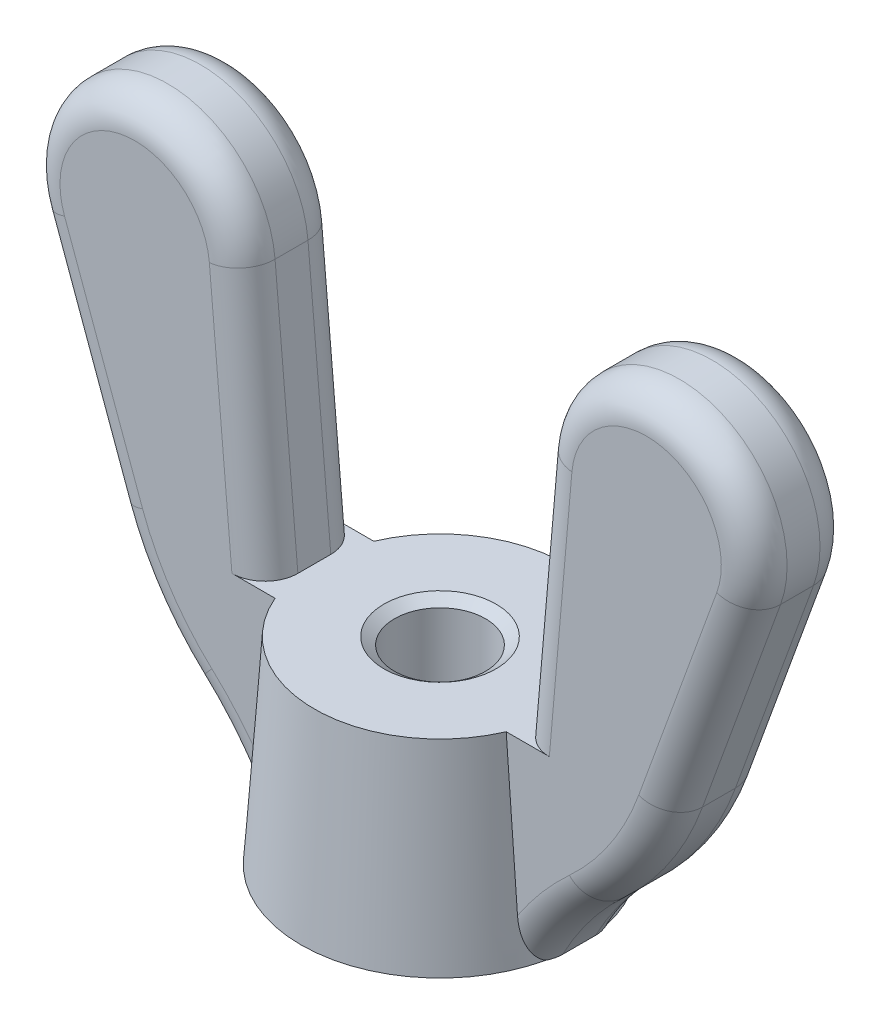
ISO-10303-21;
HEADER;
FILE_DESCRIPTION(('STEP AP214'),'2;1');
FILE_NAME('part.step','',(''),(''),'','','');
FILE_SCHEMA(('AUTOMOTIVE_DESIGN { 1 0 10303 214 1 1 1 1 }'));
ENDSEC;
DATA;
#1=APPLICATION_CONTEXT('core data for automotive mechanical design processes');
#2=APPLICATION_PROTOCOL_DEFINITION('international standard','automotive_design',2000,#1);
#3=PRODUCT_CONTEXT('',#1,'mechanical');
#4=PRODUCT('Part','Part','',(#3));
#5=PRODUCT_RELATED_PRODUCT_CATEGORY('part','',(#4));
#6=PRODUCT_DEFINITION_FORMATION('','',#4);
#7=PRODUCT_DEFINITION_CONTEXT('part definition',#1,'design');
#8=PRODUCT_DEFINITION('design','',#6,#7);
#9=PRODUCT_DEFINITION_SHAPE('','',#8);
#10=(LENGTH_UNIT() NAMED_UNIT(*) SI_UNIT(.MILLI.,.METRE.));
#11=(NAMED_UNIT(*) PLANE_ANGLE_UNIT() SI_UNIT($,.RADIAN.));
#12=(NAMED_UNIT(*) SI_UNIT($,.STERADIAN.) SOLID_ANGLE_UNIT());
#13=UNCERTAINTY_MEASURE_WITH_UNIT(LENGTH_MEASURE(1.E-05),#10,'distance_accuracy_value','');
#14=(GEOMETRIC_REPRESENTATION_CONTEXT(3) GLOBAL_UNCERTAINTY_ASSIGNED_CONTEXT((#13)) GLOBAL_UNIT_ASSIGNED_CONTEXT((#10,
#11,#12)) REPRESENTATION_CONTEXT('',''));
#15=CARTESIAN_POINT('',(0.,0.,0.));
#16=DIRECTION('',(0.,0.,1.));
#17=DIRECTION('',(1.,0.,0.));
#18=AXIS2_PLACEMENT_3D('',#15,#16,#17);
#19=CARTESIAN_POINT('',(3.93700000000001,0.,1.397));
#20=DIRECTION('',(0.,1.,0.));
#21=DIRECTION('',(-1.,0.,0.));
#22=AXIS2_PLACEMENT_3D('',#19,#20,#21);
#23=PLANE('',#22);
#24=CARTESIAN_POINT('',(0.,0.,0.));
#25=DIRECTION('',(0.,-1.,0.));
#26=DIRECTION('',(0.,0.,-1.));
#27=AXIS2_PLACEMENT_3D('',#24,#25,#26);
#28=CIRCLE('',#27,3.937);
#29=CARTESIAN_POINT('',(-3.84472764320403,0.,-0.847371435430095));
#30=VERTEX_POINT('',#29);
#31=CARTESIAN_POINT('',(3.84472764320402,0.,-0.847371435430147));
#32=VERTEX_POINT('',#31);
#33=EDGE_CURVE('E259',#30,#32,#28,.T.);
#34=ORIENTED_EDGE('',*,*,#33,.T.);
#35=CARTESIAN_POINT('',(3.84472764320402,0.,-0.847371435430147));
#36=CARTESIAN_POINT('',(3.85557217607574,0.,-0.825941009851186));
#37=CARTESIAN_POINT('',(3.8655416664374,0.,-0.804082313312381));
#38=CARTESIAN_POINT('',(3.88364311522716,0.,-0.75959867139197));
#39=CARTESIAN_POINT('',(3.89177370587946,0.,-0.736973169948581));
#40=CARTESIAN_POINT('',(3.91295529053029,0.,-0.669086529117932));
#41=CARTESIAN_POINT('',(3.9232542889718,0.,-0.622912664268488));
#42=CARTESIAN_POINT('',(3.93202507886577,0.,-0.558011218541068));
#43=CARTESIAN_POINT('',(3.93388026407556,0.,-0.539680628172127));
#44=CARTESIAN_POINT('',(3.9363719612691,0.,-0.502793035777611));
#45=CARTESIAN_POINT('',(3.93699884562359,0.,-0.484235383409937));
#46=CARTESIAN_POINT('',(3.93700000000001,0.,-0.465666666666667));
#47=B_SPLINE_CURVE_WITH_KNOTS('',3,(#35,#36,#37,#38,#39,#40,#41,#42,#43,#44,#45,#46),
.UNSPECIFIED.,.F.,.F.,(4,2,2,2,2,4),(0.,0.0720064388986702,0.144066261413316,0.285184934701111,
0.340427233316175,0.396100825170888),.UNSPECIFIED.);
#48=CARTESIAN_POINT('',(3.93700000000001,0.,-0.465666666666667));
#49=VERTEX_POINT('',#48);
#50=EDGE_CURVE('E383',#32,#49,#47,.T.);
#51=ORIENTED_EDGE('',*,*,#50,.T.);
#52=DIRECTION('',(0.,0.,-1.));
#53=VECTOR('',#52,1.);
#54=CARTESIAN_POINT('',(3.93700000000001,0.,1.397));
#55=LINE('',#54,#53);
#56=CARTESIAN_POINT('',(3.93700000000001,0.,0.465666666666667));
#57=VERTEX_POINT('',#56);
#58=EDGE_CURVE('E575',#57,#49,#55,.T.);
#59=ORIENTED_EDGE('',*,*,#58,.F.);
#60=CARTESIAN_POINT('',(3.93700000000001,0.,0.465666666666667));
#61=CARTESIAN_POINT('',(3.93700040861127,0.,0.489688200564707));
#62=CARTESIAN_POINT('',(3.93594933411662,0.,0.513693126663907));
#63=CARTESIAN_POINT('',(3.93176556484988,0.,0.561524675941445));
#64=CARTESIAN_POINT('',(3.9286325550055,0.,0.585351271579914));
#65=CARTESIAN_POINT('',(3.91631127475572,0.,0.655379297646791));
#66=CARTESIAN_POINT('',(3.9041973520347,0.,0.701111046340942));
#67=CARTESIAN_POINT('',(3.88227769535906,0.,0.762836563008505));
#68=CARTESIAN_POINT('',(3.87555229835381,0.,0.779993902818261));
#69=CARTESIAN_POINT('',(3.86097347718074,0.,0.81397803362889));
#70=CARTESIAN_POINT('',(3.85311182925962,0.,0.830801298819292));
#71=CARTESIAN_POINT('',(3.84472764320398,0.,0.847371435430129));
#72=B_SPLINE_CURVE_WITH_KNOTS('',3,(#60,#61,#62,#63,#64,#65,#66,#67,#68,#69,#70,#71),
.UNSPECIFIED.,.F.,.F.,(4,2,2,2,2,4),(0.,0.0720090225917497,0.144028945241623,0.285160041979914,
0.340419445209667,0.396100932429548),.UNSPECIFIED.);
#73=CARTESIAN_POINT('',(3.84472764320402,0.,0.847371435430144));
#74=VERTEX_POINT('',#73);
#75=EDGE_CURVE('E355',#57,#74,#72,.T.);
#76=ORIENTED_EDGE('',*,*,#75,.T.);
#77=CARTESIAN_POINT('',(-3.84472764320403,0.,0.847371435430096));
#78=VERTEX_POINT('',#77);
#79=EDGE_CURVE('E250',#74,#78,#28,.T.);
#80=ORIENTED_EDGE('',*,*,#79,.T.);
#81=CARTESIAN_POINT('',(-3.84472764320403,0.,0.847371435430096));
#82=CARTESIAN_POINT('',(-3.85557217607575,0.,0.825941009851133));
#83=CARTESIAN_POINT('',(-3.86554166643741,0.,0.804082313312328));
#84=CARTESIAN_POINT('',(-3.88364311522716,0.,0.759598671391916));
#85=CARTESIAN_POINT('',(-3.89177370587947,0.,0.736973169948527));
#86=CARTESIAN_POINT('',(-3.91295529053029,0.,0.669086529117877));
#87=CARTESIAN_POINT('',(-3.9232542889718,0.,0.622912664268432));
#88=CARTESIAN_POINT('',(-3.93202507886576,0.,0.558011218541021));
#89=CARTESIAN_POINT('',(-3.93388026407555,0.,0.539680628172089));
#90=CARTESIAN_POINT('',(-3.93637196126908,0.,0.502793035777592));
#91=CARTESIAN_POINT('',(-3.93699884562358,0.,0.484235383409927));
#92=CARTESIAN_POINT('',(-3.937,0.,0.465666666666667));
#93=B_SPLINE_CURVE_WITH_KNOTS('',3,(#81,#82,#83,#84,#85,#86,#87,#88,#89,#90,#91,#92),
.UNSPECIFIED.,.F.,.F.,(4,2,2,2,2,4),(0.,0.0720064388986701,0.144066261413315,0.285184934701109,
0.340427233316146,0.39610082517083),.UNSPECIFIED.);
#94=CARTESIAN_POINT('',(-3.937,0.,0.465666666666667));
#95=VERTEX_POINT('',#94);
#96=EDGE_CURVE('E365',#78,#95,#93,.T.);
#97=ORIENTED_EDGE('',*,*,#96,.T.);
#98=DIRECTION('',(0.,0.,-1.));
#99=VECTOR('',#98,1.);
#100=CARTESIAN_POINT('',(-3.937,0.,1.397));
#101=LINE('',#100,#99);
#102=CARTESIAN_POINT('',(-3.937,0.,-0.465666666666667));
#103=VERTEX_POINT('',#102);
#104=EDGE_CURVE('E621',#95,#103,#101,.T.);
#105=ORIENTED_EDGE('',*,*,#104,.T.);
#106=CARTESIAN_POINT('',(-3.937,0.,-0.465666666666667));
#107=CARTESIAN_POINT('',(-3.93700040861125,0.,-0.489688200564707));
#108=CARTESIAN_POINT('',(-3.9359493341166,0.,-0.513693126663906));
#109=CARTESIAN_POINT('',(-3.93176556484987,0.,-0.561524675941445));
#110=CARTESIAN_POINT('',(-3.92863255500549,0.,-0.585351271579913));
#111=CARTESIAN_POINT('',(-3.9163112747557,0.,-0.65537929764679));
#112=CARTESIAN_POINT('',(-3.90419735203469,0.,-0.701111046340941));
#113=CARTESIAN_POINT('',(-3.88227769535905,0.,-0.762836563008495));
#114=CARTESIAN_POINT('',(-3.87555229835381,0.,-0.779993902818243));
#115=CARTESIAN_POINT('',(-3.86097347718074,0.,-0.813978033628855));
#116=CARTESIAN_POINT('',(-3.85311182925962,0.,-0.83080129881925));
#117=CARTESIAN_POINT('',(-3.84472764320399,0.,-0.847371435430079));
#118=B_SPLINE_CURVE_WITH_KNOTS('',3,(#106,#107,#108,#109,#110,#111,#112,#113,#114,#115,#116,
#117),.UNSPECIFIED.,.F.,.F.,(4,2,2,2,2,4),(0.,0.0720090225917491,0.144028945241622,
0.285160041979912,0.340419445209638,0.396100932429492),.UNSPECIFIED.);
#119=EDGE_CURVE('E363',#103,#30,#118,.T.);
#120=ORIENTED_EDGE('',*,*,#119,.T.);
#121=EDGE_LOOP('',(#34,#51,#59,#76,#80,#97,#105,#120));
#122=FACE_BOUND('',#121,.T.);
#123=CARTESIAN_POINT('',(0.,0.,0.));
#124=DIRECTION('',(0.,1.,0.));
#125=DIRECTION('',(-1.,0.,0.));
#126=AXIS2_PLACEMENT_3D('',#123,#124,#125);
#127=CIRCLE('',#126,1.58749999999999);
#128=CARTESIAN_POINT('',(-1.58749999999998,0.,0.));
#129=VERTEX_POINT('',#128);
#130=EDGE_CURVE('E605',#129,#129,#127,.T.);
#131=ORIENTED_EDGE('',*,*,#130,.T.);
#132=EDGE_LOOP('',(#131));
#133=FACE_BOUND('',#132,.T.);
#134=ADVANCED_FACE('F50',(#122,#133),#23,.F.);
#135=CARTESIAN_POINT('',(7.23840628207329,12.6994062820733,1.397));
#136=DIRECTION('',(0.,0.,-1.));
#137=DIRECTION('',(-1.,0.,0.));
#138=AXIS2_PLACEMENT_3D('',#135,#136,#137);
#139=PLANE('',#138);
#140=CARTESIAN_POINT('',(0.,8.4612944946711,1.397));
#141=DIRECTION('',(0.,0.,-1.));
#142=DIRECTION('',(-1.,0.,0.));
#143=AXIS2_PLACEMENT_3D('',#140,#141,#142);
#144=CIRCLE('',#143,7.46961775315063);
#145=CARTESIAN_POINT('',(-7.01914468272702,5.90653476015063,1.397));
#146=VERTEX_POINT('',#145);
#147=CARTESIAN_POINT('',(-5.057378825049,2.96419445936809,1.397));
#148=VERTEX_POINT('',#147);
#149=EDGE_CURVE('E503',#146,#148,#144,.F.);
#150=ORIENTED_EDGE('',*,*,#149,.T.);
#151=CARTESIAN_POINT('',(-11.3758946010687,-3.90369392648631,1.397));
#152=DIRECTION('',(0.,0.,-1.));
#153=DIRECTION('',(-1.,0.,0.));
#154=AXIS2_PLACEMENT_3D('',#151,#152,#153);
#155=CIRCLE('',#154,9.33228441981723);
#156=CARTESIAN_POINT('',(-3.59012450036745,1.24152875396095,1.397));
#157=VERTEX_POINT('',#156);
#158=EDGE_CURVE('E499',#148,#157,#155,.T.);
#159=ORIENTED_EDGE('',*,*,#158,.T.);
#160=CARTESIAN_POINT('',(-2.53867458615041,15.2435415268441,1.397));
#161=CARTESIAN_POINT('',(-2.60883110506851,14.3418946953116,1.397));
#162=CARTESIAN_POINT('',(-2.67834194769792,13.4401979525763,1.397));
#163=CARTESIAN_POINT('',(-2.81629610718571,11.6367239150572,1.397));
#164=CARTESIAN_POINT('',(-2.88473942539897,10.7349466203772,1.397));
#165=CARTESIAN_POINT('',(-3.0752390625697,8.20936047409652,1.397));
#166=CARTESIAN_POINT('',(-3.19634976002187,6.58548035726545,1.397));
#167=CARTESIAN_POINT('',(-3.43663846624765,3.33757667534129,1.397));
#168=CARTESIAN_POINT('',(-3.55581647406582,1.71355311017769,1.397));
#169=CARTESIAN_POINT('',(-3.79275127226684,-1.53460548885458,1.397));
#170=CARTESIAN_POINT('',(-3.91050805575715,-3.15874052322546,1.397));
#171=CARTESIAN_POINT('',(-4.14491971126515,-6.40708829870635,1.397));
#172=CARTESIAN_POINT('',(-4.26157458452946,-8.03130103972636,1.397));
#173=CARTESIAN_POINT('',(-4.37783858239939,-9.65554152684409,1.397));
#174=B_SPLINE_CURVE_WITH_KNOTS('',3,(#160,#161,#162,#163,#164,#165,#166,#167,#168,#169,#170,
#171,#172,#173),.UNSPECIFIED.,.F.,.F.,(4,2,2,2,2,2,4),(0.,2.71311566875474,5.42622789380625,
10.3113965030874,15.1965675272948,20.0817622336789,24.9669514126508),.UNSPECIFIED.);
#175=CARTESIAN_POINT('',(-3.27009587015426,5.588,1.397));
#176=VERTEX_POINT('',#175);
#177=EDGE_CURVE('E246',#176,#157,#174,.T.);
#178=ORIENTED_EDGE('',*,*,#177,.F.);
#179=DIRECTION('',(-1.,0.,0.));
#180=VECTOR('',#179,1.);
#181=CARTESIAN_POINT('',(-3.55599999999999,5.588,1.397));
#182=LINE('',#181,#180);
#183=CARTESIAN_POINT('',(-4.49089087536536,5.588,1.397));
#184=VERTEX_POINT('',#183);
#185=EDGE_CURVE('E256',#176,#184,#182,.T.);
#186=ORIENTED_EDGE('',*,*,#185,.T.);
#187=DIRECTION('',(-0.0871557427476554,0.996194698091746,0.));
#188=VECTOR('',#187,1.);
#189=CARTESIAN_POINT('',(-5.01923505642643,11.6270016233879,1.397));
#190=LINE('',#189,#188);
#191=CARTESIAN_POINT('',(-5.12920271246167,12.8839376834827,1.397));
#192=VERTEX_POINT('',#191);
#193=EDGE_CURVE('E495',#184,#192,#190,.T.);
#194=ORIENTED_EDGE('',*,*,#193,.T.);
#195=CARTESIAN_POINT('',(-7.23840628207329,12.6994062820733,1.397));
#196=DIRECTION('',(0.,0.,-1.));
#197=DIRECTION('',(-1.,0.,0.));
#198=AXIS2_PLACEMENT_3D('',#195,#196,#197);
#199=CIRCLE('',#198,2.11726038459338);
#200=CARTESIAN_POINT('',(-9.22798024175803,11.9752605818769,1.397));
#201=VERTEX_POINT('',#200);
#202=EDGE_CURVE('E486',#192,#201,#199,.F.);
#203=ORIENTED_EDGE('',*,*,#202,.T.);
#204=DIRECTION('',(0.34202014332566,-0.939692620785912,0.));
#205=VECTOR('',#204,1.);
#206=CARTESIAN_POINT('',(-7.53451486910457,7.3225027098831,1.397));
#207=LINE('',#206,#205);
#208=EDGE_CURVE('E504',#201,#146,#207,.T.);
#209=ORIENTED_EDGE('',*,*,#208,.T.);
#210=EDGE_LOOP('',(#150,#159,#178,#186,#194,#203,#209));
#211=FACE_BOUND('',#210,.T.);
#212=ADVANCED_FACE('F279',(#211),#139,.F.);
#213=CARTESIAN_POINT('',(4.37783858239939,-9.65554152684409,1.397));
#214=CARTESIAN_POINT('',(4.27544426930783,-8.2249837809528,1.397));
#215=CARTESIAN_POINT('',(4.17273962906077,-6.79444812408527,1.397));
#216=CARTESIAN_POINT('',(3.96650348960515,-3.93343820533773,1.397));
#217=CARTESIAN_POINT('',(3.86297199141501,-2.50296394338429,1.397));
#218=CARTESIAN_POINT('',(3.66000814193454,0.287349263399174,1.397));
#219=CARTESIAN_POINT('',(3.56062550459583,1.64719182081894,1.397));
#220=CARTESIAN_POINT('',(3.36066061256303,4.36678847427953,1.397));
#221=CARTESIAN_POINT('',(3.26007835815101,5.72654257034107,1.397));
#222=CARTESIAN_POINT('',(3.05734265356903,8.44593710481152,1.397));
#223=CARTESIAN_POINT('',(2.95518919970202,9.80557754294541,1.397));
#224=CARTESIAN_POINT('',(2.80035690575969,11.8449172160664,1.397));
#225=CARTESIAN_POINT('',(2.74847909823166,12.524677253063,1.397));
#226=CARTESIAN_POINT('',(2.64408340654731,13.8841483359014,1.397));
#227=CARTESIAN_POINT('',(2.59156552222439,14.5638593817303,1.397));
#228=CARTESIAN_POINT('',(2.53867458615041,15.2435415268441,1.397));
#229=B_SPLINE_CURVE_WITH_KNOTS('',3,(#213,#214,#215,#216,#217,#218,#219,#220,#221,#222,#223,
#224,#225,#226,#227,#228),.UNSPECIFIED.,.F.,.F.,(4,2,2,2,2,2,2,4),(0.,4.30265288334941,
8.60530046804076,12.6957081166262,16.786114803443,20.8765311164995,22.9217411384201,
24.9669516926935),.UNSPECIFIED.);
#230=CARTESIAN_POINT('',(3.5901245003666,1.24152875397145,1.397));
#231=VERTEX_POINT('',#230);
#232=CARTESIAN_POINT('',(3.27009587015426,5.588,1.397));
#233=VERTEX_POINT('',#232);
#234=EDGE_CURVE('E232',#231,#233,#229,.T.);
#235=ORIENTED_EDGE('',*,*,#234,.F.);
#236=CARTESIAN_POINT('',(11.3758946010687,-3.90369392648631,1.397));
#237=DIRECTION('',(0.,0.,-1.));
#238=DIRECTION('',(-1.,0.,0.));
#239=AXIS2_PLACEMENT_3D('',#236,#237,#238);
#240=CIRCLE('',#239,9.33228441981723);
#241=CARTESIAN_POINT('',(5.05737882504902,2.96419445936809,1.397));
#242=VERTEX_POINT('',#241);
#243=EDGE_CURVE('E508',#231,#242,#240,.T.);
#244=ORIENTED_EDGE('',*,*,#243,.T.);
#245=CARTESIAN_POINT('',(0.,8.46129449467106,1.397));
#246=DIRECTION('',(0.,0.,-1.));
#247=DIRECTION('',(-1.,0.,0.));
#248=AXIS2_PLACEMENT_3D('',#245,#246,#247);
#249=CIRCLE('',#248,7.46961775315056);
#250=CARTESIAN_POINT('',(7.01914468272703,5.90653476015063,1.397));
#251=VERTEX_POINT('',#250);
#252=EDGE_CURVE('E512',#242,#251,#249,.F.);
#253=ORIENTED_EDGE('',*,*,#252,.T.);
#254=DIRECTION('',(0.342020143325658,0.939692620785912,0.));
#255=VECTOR('',#254,1.);
#256=CARTESIAN_POINT('',(9.22798024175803,11.9752605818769,1.397));
#257=LINE('',#256,#255);
#258=CARTESIAN_POINT('',(9.22798024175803,11.9752605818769,1.397));
#259=VERTEX_POINT('',#258);
#260=EDGE_CURVE('E514',#251,#259,#257,.T.);
#261=ORIENTED_EDGE('',*,*,#260,.T.);
#262=CARTESIAN_POINT('',(7.23840628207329,12.6994062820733,1.397));
#263=DIRECTION('',(0.,0.,-1.));
#264=DIRECTION('',(-1.,0.,0.));
#265=AXIS2_PLACEMENT_3D('',#262,#263,#264);
#266=CIRCLE('',#265,2.11726038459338);
#267=CARTESIAN_POINT('',(5.12920271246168,12.8839376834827,1.397));
#268=VERTEX_POINT('',#267);
#269=EDGE_CURVE('E513',#259,#268,#266,.F.);
#270=ORIENTED_EDGE('',*,*,#269,.T.);
#271=DIRECTION('',(-0.087155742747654,-0.996194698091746,0.));
#272=VECTOR('',#271,1.);
#273=CARTESIAN_POINT('',(5.12920271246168,12.8839376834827,1.397));
#274=LINE('',#273,#272);
#275=CARTESIAN_POINT('',(4.49089087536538,5.588,1.397));
#276=VERTEX_POINT('',#275);
#277=EDGE_CURVE('E254',#268,#276,#274,.T.);
#278=ORIENTED_EDGE('',*,*,#277,.T.);
#279=EDGE_CURVE('E249',#276,#233,#182,.T.);
#280=ORIENTED_EDGE('',*,*,#279,.T.);
#281=EDGE_LOOP('',(#235,#244,#253,#261,#270,#278,#280));
#282=FACE_BOUND('',#281,.T.);
#283=ADVANCED_FACE('F252',(#282),#139,.F.);
#284=CARTESIAN_POINT('',(7.23840628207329,12.6994062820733,-1.397));
#285=DIRECTION('',(0.,0.,-1.));
#286=DIRECTION('',(-1.,0.,0.));
#287=AXIS2_PLACEMENT_3D('',#284,#285,#286);
#288=PLANE('',#287);
#289=CARTESIAN_POINT('',(-2.53867458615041,15.2435415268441,-1.397));
#290=CARTESIAN_POINT('',(-2.60883110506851,14.3418946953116,-1.397));
#291=CARTESIAN_POINT('',(-2.67834194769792,13.4401979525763,-1.397));
#292=CARTESIAN_POINT('',(-2.81629610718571,11.6367239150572,-1.397));
#293=CARTESIAN_POINT('',(-2.88473942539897,10.7349466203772,-1.397));
#294=CARTESIAN_POINT('',(-3.0752390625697,8.20936047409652,-1.397));
#295=CARTESIAN_POINT('',(-3.19634976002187,6.58548035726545,-1.397));
#296=CARTESIAN_POINT('',(-3.43663846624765,3.33757667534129,-1.397));
#297=CARTESIAN_POINT('',(-3.55581647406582,1.71355311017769,-1.397));
#298=CARTESIAN_POINT('',(-3.79275127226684,-1.53460548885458,-1.397));
#299=CARTESIAN_POINT('',(-3.91050805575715,-3.15874052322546,-1.397));
#300=CARTESIAN_POINT('',(-4.14491971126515,-6.40708829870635,-1.397));
#301=CARTESIAN_POINT('',(-4.26157458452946,-8.03130103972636,-1.397));
#302=CARTESIAN_POINT('',(-4.37783858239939,-9.65554152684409,-1.397));
#303=B_SPLINE_CURVE_WITH_KNOTS('',3,(#289,#290,#291,#292,#293,#294,#295,#296,#297,#298,#299,
#300,#301,#302),.UNSPECIFIED.,.F.,.F.,(4,2,2,2,2,2,4),(0.,2.71311566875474,5.42622789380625,
10.3113965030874,15.1965675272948,20.0817622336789,24.9669514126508),.UNSPECIFIED.);
#304=CARTESIAN_POINT('',(-3.27009587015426,5.588,-1.397));
#305=VERTEX_POINT('',#304);
#306=CARTESIAN_POINT('',(-3.59012450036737,1.24152875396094,-1.397));
#307=VERTEX_POINT('',#306);
#308=EDGE_CURVE('E303',#305,#307,#303,.T.);
#309=ORIENTED_EDGE('',*,*,#308,.T.);
#310=CARTESIAN_POINT('',(-11.3758946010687,-3.90369392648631,-1.397));
#311=DIRECTION('',(0.,0.,-1.));
#312=DIRECTION('',(-1.,0.,0.));
#313=AXIS2_PLACEMENT_3D('',#310,#311,#312);
#314=CIRCLE('',#313,9.33228441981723);
#315=CARTESIAN_POINT('',(-5.057378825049,2.96419445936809,-1.397));
#316=VERTEX_POINT('',#315);
#317=EDGE_CURVE('E529',#307,#316,#314,.F.);
#318=ORIENTED_EDGE('',*,*,#317,.T.);
#319=CARTESIAN_POINT('',(0.,8.4612944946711,-1.397));
#320=DIRECTION('',(0.,0.,-1.));
#321=DIRECTION('',(-1.,0.,0.));
#322=AXIS2_PLACEMENT_3D('',#319,#320,#321);
#323=CIRCLE('',#322,7.46961775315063);
#324=CARTESIAN_POINT('',(-7.01914468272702,5.90653476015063,-1.397));
#325=VERTEX_POINT('',#324);
#326=EDGE_CURVE('E528',#316,#325,#323,.T.);
#327=ORIENTED_EDGE('',*,*,#326,.T.);
#328=DIRECTION('',(0.34202014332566,-0.939692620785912,0.));
#329=VECTOR('',#328,1.);
#330=CARTESIAN_POINT('',(-9.22798024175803,11.9752605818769,-1.397));
#331=LINE('',#330,#329);
#332=CARTESIAN_POINT('',(-9.22798024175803,11.9752605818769,-1.397));
#333=VERTEX_POINT('',#332);
#334=EDGE_CURVE('E535',#325,#333,#331,.F.);
#335=ORIENTED_EDGE('',*,*,#334,.T.);
#336=CARTESIAN_POINT('',(-7.23840628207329,12.6994062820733,-1.397));
#337=DIRECTION('',(0.,0.,-1.));
#338=DIRECTION('',(-1.,0.,0.));
#339=AXIS2_PLACEMENT_3D('',#336,#337,#338);
#340=CIRCLE('',#339,2.11726038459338);
#341=CARTESIAN_POINT('',(-5.12920271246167,12.8839376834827,-1.397));
#342=VERTEX_POINT('',#341);
#343=EDGE_CURVE('E443',#333,#342,#340,.T.);
#344=ORIENTED_EDGE('',*,*,#343,.T.);
#345=DIRECTION('',(-0.0871557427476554,0.996194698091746,0.));
#346=VECTOR('',#345,1.);
#347=CARTESIAN_POINT('',(-4.48378932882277,5.50682895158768,-1.397));
#348=LINE('',#347,#346);
#349=CARTESIAN_POINT('',(-4.49089087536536,5.588,-1.397));
#350=VERTEX_POINT('',#349);
#351=EDGE_CURVE('E533',#342,#350,#348,.F.);
#352=ORIENTED_EDGE('',*,*,#351,.T.);
#353=DIRECTION('',(-1.,0.,0.));
#354=VECTOR('',#353,1.);
#355=CARTESIAN_POINT('',(-3.55599999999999,5.588,-1.397));
#356=LINE('',#355,#354);
#357=EDGE_CURVE('E653',#305,#350,#356,.T.);
#358=ORIENTED_EDGE('',*,*,#357,.F.);
#359=EDGE_LOOP('',(#309,#318,#327,#335,#344,#352,#358));
#360=FACE_BOUND('',#359,.T.);
#361=ADVANCED_FACE('F614',(#360),#288,.T.);
#362=CARTESIAN_POINT('',(0.,8.46129449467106,-1.397));
#363=DIRECTION('',(0.,0.,-1.));
#364=DIRECTION('',(-1.,0.,0.));
#365=AXIS2_PLACEMENT_3D('',#362,#363,#364);
#366=CIRCLE('',#365,7.46961775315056);
#367=CARTESIAN_POINT('',(7.01914468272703,5.90653476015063,-1.397));
#368=VERTEX_POINT('',#367);
#369=CARTESIAN_POINT('',(5.05737882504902,2.96419445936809,-1.397));
#370=VERTEX_POINT('',#369);
#371=EDGE_CURVE('E675',#368,#370,#366,.T.);
#372=ORIENTED_EDGE('',*,*,#371,.T.);
#373=CARTESIAN_POINT('',(11.3758946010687,-3.90369392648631,-1.397));
#374=DIRECTION('',(0.,0.,-1.));
#375=DIRECTION('',(-1.,0.,0.));
#376=AXIS2_PLACEMENT_3D('',#373,#374,#375);
#377=CIRCLE('',#376,9.33228441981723);
#378=CARTESIAN_POINT('',(3.59012450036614,1.24152875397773,-1.397));
#379=VERTEX_POINT('',#378);
#380=EDGE_CURVE('E647',#370,#379,#377,.F.);
#381=ORIENTED_EDGE('',*,*,#380,.T.);
#382=CARTESIAN_POINT('',(4.37783858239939,-9.65554152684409,-1.397));
#383=CARTESIAN_POINT('',(4.27544426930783,-8.2249837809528,-1.397));
#384=CARTESIAN_POINT('',(4.17273962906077,-6.79444812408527,-1.397));
#385=CARTESIAN_POINT('',(3.96650348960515,-3.93343820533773,-1.397));
#386=CARTESIAN_POINT('',(3.86297199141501,-2.50296394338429,-1.397));
#387=CARTESIAN_POINT('',(3.66000814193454,0.287349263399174,-1.397));
#388=CARTESIAN_POINT('',(3.56062550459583,1.64719182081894,-1.397));
#389=CARTESIAN_POINT('',(3.36066061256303,4.36678847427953,-1.397));
#390=CARTESIAN_POINT('',(3.26007835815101,5.72654257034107,-1.397));
#391=CARTESIAN_POINT('',(3.05734265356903,8.44593710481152,-1.397));
#392=CARTESIAN_POINT('',(2.95518919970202,9.80557754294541,-1.397));
#393=CARTESIAN_POINT('',(2.80035690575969,11.8449172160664,-1.397));
#394=CARTESIAN_POINT('',(2.74847909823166,12.524677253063,-1.397));
#395=CARTESIAN_POINT('',(2.64408340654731,13.8841483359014,-1.397));
#396=CARTESIAN_POINT('',(2.59156552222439,14.5638593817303,-1.397));
#397=CARTESIAN_POINT('',(2.53867458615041,15.2435415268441,-1.397));
#398=B_SPLINE_CURVE_WITH_KNOTS('',3,(#382,#383,#384,#385,#386,#387,#388,#389,#390,#391,#392,
#393,#394,#395,#396,#397),.UNSPECIFIED.,.F.,.F.,(4,2,2,2,2,2,2,4),(0.,4.30265288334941,
8.60530046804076,12.6957081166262,16.786114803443,20.8765311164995,22.9217411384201,
24.9669516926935),.UNSPECIFIED.);
#399=CARTESIAN_POINT('',(3.27009587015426,5.588,-1.397));
#400=VERTEX_POINT('',#399);
#401=EDGE_CURVE('E291',#379,#400,#398,.T.);
#402=ORIENTED_EDGE('',*,*,#401,.T.);
#403=CARTESIAN_POINT('',(4.49089087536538,5.588,-1.397));
#404=VERTEX_POINT('',#403);
#405=EDGE_CURVE('E643',#404,#400,#356,.T.);
#406=ORIENTED_EDGE('',*,*,#405,.F.);
#407=DIRECTION('',(-0.087155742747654,-0.996194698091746,0.));
#408=VECTOR('',#407,1.);
#409=CARTESIAN_POINT('',(5.12920271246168,12.8839376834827,-1.397));
#410=LINE('',#409,#408);
#411=CARTESIAN_POINT('',(5.12920271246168,12.8839376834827,-1.397));
#412=VERTEX_POINT('',#411);
#413=EDGE_CURVE('E682',#404,#412,#410,.F.);
#414=ORIENTED_EDGE('',*,*,#413,.T.);
#415=CARTESIAN_POINT('',(7.23840628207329,12.6994062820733,-1.397));
#416=DIRECTION('',(0.,0.,-1.));
#417=DIRECTION('',(-1.,0.,0.));
#418=AXIS2_PLACEMENT_3D('',#415,#416,#417);
#419=CIRCLE('',#418,2.11726038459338);
#420=CARTESIAN_POINT('',(9.22798024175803,11.9752605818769,-1.397));
#421=VERTEX_POINT('',#420);
#422=EDGE_CURVE('E679',#412,#421,#419,.T.);
#423=ORIENTED_EDGE('',*,*,#422,.T.);
#424=DIRECTION('',(0.342020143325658,0.939692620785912,0.));
#425=VECTOR('',#424,1.);
#426=CARTESIAN_POINT('',(7.01914468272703,5.90653476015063,-1.397));
#427=LINE('',#426,#425);
#428=EDGE_CURVE('E677',#421,#368,#427,.F.);
#429=ORIENTED_EDGE('',*,*,#428,.T.);
#430=EDGE_LOOP('',(#372,#381,#402,#406,#414,#423,#429));
#431=FACE_BOUND('',#430,.T.);
#432=ADVANCED_FACE('F644',(#431),#288,.T.);
#433=CARTESIAN_POINT('',(-4.20141338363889,12.965108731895,1.397));
#434=DIRECTION('',(-0.996194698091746,-0.0871557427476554,0.));
#435=DIRECTION('',(0.0871557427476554,-0.996194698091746,0.));
#436=AXIS2_PLACEMENT_3D('',#433,#434,#435);
#437=PLANE('',#436);
#438=DIRECTION('',(0.,0.,-1.));
#439=VECTOR('',#438,1.);
#440=CARTESIAN_POINT('',(-3.55599999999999,5.588,1.397));
#441=LINE('',#440,#439);
#442=CARTESIAN_POINT('',(-3.55599999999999,5.588,0.465666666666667));
#443=VERTEX_POINT('',#442);
#444=CARTESIAN_POINT('',(-3.55599999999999,5.588,-0.465666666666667));
#445=VERTEX_POINT('',#444);
#446=EDGE_CURVE('E253',#443,#445,#441,.T.);
#447=ORIENTED_EDGE('',*,*,#446,.T.);
#448=DIRECTION('',(-0.0871557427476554,0.996194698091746,0.));
#449=VECTOR('',#448,1.);
#450=CARTESIAN_POINT('',(-4.20141338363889,12.965108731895,-0.465666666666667));
#451=LINE('',#450,#449);
#452=CARTESIAN_POINT('',(-4.20141338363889,12.965108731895,-0.465666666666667));
#453=VERTEX_POINT('',#452);
#454=EDGE_CURVE('E491',#445,#453,#451,.T.);
#455=ORIENTED_EDGE('',*,*,#454,.T.);
#456=DIRECTION('',(0.,0.,-1.));
#457=VECTOR('',#456,1.);
#458=CARTESIAN_POINT('',(-4.20141338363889,12.965108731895,1.397));
#459=LINE('',#458,#457);
#460=CARTESIAN_POINT('',(-4.20141338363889,12.965108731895,0.465666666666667));
#461=VERTEX_POINT('',#460);
#462=EDGE_CURVE('E637',#461,#453,#459,.T.);
#463=ORIENTED_EDGE('',*,*,#462,.F.);
#464=DIRECTION('',(-0.0871557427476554,0.996194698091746,0.));
#465=VECTOR('',#464,1.);
#466=CARTESIAN_POINT('',(-4.20141338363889,12.965108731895,0.465666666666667));
#467=LINE('',#466,#465);
#468=EDGE_CURVE('E72',#461,#443,#467,.F.);
#469=ORIENTED_EDGE('',*,*,#468,.T.);
#470=EDGE_LOOP('',(#447,#455,#463,#469));
#471=FACE_BOUND('',#470,.T.);
#472=ADVANCED_FACE('F398',(#471),#437,.F.);
#473=CARTESIAN_POINT('',(-7.23840628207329,12.6994062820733,1.397));
#474=DIRECTION('',(0.,0.,-1.));
#475=DIRECTION('',(-1.,0.,0.));
#476=AXIS2_PLACEMENT_3D('',#473,#474,#475);
#477=CYLINDRICAL_SURFACE('',#476,3.04859371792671);
#478=ORIENTED_EDGE('',*,*,#462,.T.);
#479=CARTESIAN_POINT('',(-7.23840628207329,12.6994062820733,-0.465666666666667));
#480=DIRECTION('',(0.,0.,-1.));
#481=DIRECTION('',(-1.,0.,0.));
#482=AXIS2_PLACEMENT_3D('',#479,#480,#481);
#483=CIRCLE('',#482,3.04859371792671);
#484=CARTESIAN_POINT('',(-10.1031473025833,11.6567258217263,-0.465666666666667));
#485=VERTEX_POINT('',#484);
#486=EDGE_CURVE('E447',#453,#485,#483,.F.);
#487=ORIENTED_EDGE('',*,*,#486,.T.);
#488=DIRECTION('',(0.,0.,-1.));
#489=VECTOR('',#488,1.);
#490=CARTESIAN_POINT('',(-10.1031473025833,11.6567258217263,1.397));
#491=LINE('',#490,#489);
#492=CARTESIAN_POINT('',(-10.1031473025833,11.6567258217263,0.465666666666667));
#493=VERTEX_POINT('',#492);
#494=EDGE_CURVE('E636',#493,#485,#491,.T.);
#495=ORIENTED_EDGE('',*,*,#494,.F.);
#496=CARTESIAN_POINT('',(-7.23840628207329,12.6994062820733,0.465666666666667));
#497=DIRECTION('',(0.,0.,-1.));
#498=DIRECTION('',(-1.,0.,0.));
#499=AXIS2_PLACEMENT_3D('',#496,#497,#498);
#500=CIRCLE('',#499,3.04859371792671);
#501=EDGE_CURVE('E487',#493,#461,#500,.T.);
#502=ORIENTED_EDGE('',*,*,#501,.T.);
#503=EDGE_LOOP('',(#478,#487,#495,#502));
#504=FACE_BOUND('',#503,.T.);
#505=ADVANCED_FACE('F708',(#504),#477,.T.);
#506=CARTESIAN_POINT('',(-10.1031473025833,11.6567258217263,1.397));
#507=DIRECTION('',(0.939692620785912,0.34202014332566,0.));
#508=DIRECTION('',(-0.34202014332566,0.939692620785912,0.));
#509=AXIS2_PLACEMENT_3D('',#506,#507,#508);
#510=PLANE('',#509);
#511=ORIENTED_EDGE('',*,*,#494,.T.);
#512=DIRECTION('',(0.34202014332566,-0.939692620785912,0.));
#513=VECTOR('',#512,1.);
#514=CARTESIAN_POINT('',(-7.8943117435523,5.58799999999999,-0.465666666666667));
#515=LINE('',#514,#513);
#516=CARTESIAN_POINT('',(-7.8943117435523,5.58799999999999,-0.465666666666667));
#517=VERTEX_POINT('',#516);
#518=EDGE_CURVE('E519',#485,#517,#515,.T.);
#519=ORIENTED_EDGE('',*,*,#518,.T.);
#520=DIRECTION('',(0.,0.,-1.));
#521=VECTOR('',#520,1.);
#522=CARTESIAN_POINT('',(-7.8943117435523,5.58799999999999,1.397));
#523=LINE('',#522,#521);
#524=CARTESIAN_POINT('',(-7.8943117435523,5.58799999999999,0.465666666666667));
#525=VERTEX_POINT('',#524);
#526=EDGE_CURVE('E629',#525,#517,#523,.T.);
#527=ORIENTED_EDGE('',*,*,#526,.F.);
#528=DIRECTION('',(0.34202014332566,-0.939692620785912,0.));
#529=VECTOR('',#528,1.);
#530=CARTESIAN_POINT('',(-10.1031473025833,11.6567258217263,0.465666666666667));
#531=LINE('',#530,#529);
#532=EDGE_CURVE('E522',#525,#493,#531,.F.);
#533=ORIENTED_EDGE('',*,*,#532,.T.);
#534=EDGE_LOOP('',(#511,#519,#527,#533));
#535=FACE_BOUND('',#534,.T.);
#536=ADVANCED_FACE('F706',(#535),#510,.F.);
#537=CARTESIAN_POINT('',(0.,8.4612944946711,1.397));
#538=DIRECTION('',(0.,0.,-1.));
#539=DIRECTION('',(-1.,0.,0.));
#540=AXIS2_PLACEMENT_3D('',#537,#538,#539);
#541=CYLINDRICAL_SURFACE('',#540,8.40095108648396);
#542=ORIENTED_EDGE('',*,*,#526,.T.);
#543=CARTESIAN_POINT('',(0.,8.4612944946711,-0.465666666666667));
#544=DIRECTION('',(0.,0.,-1.));
#545=DIRECTION('',(-1.,0.,0.));
#546=AXIS2_PLACEMENT_3D('',#543,#544,#545);
#547=CIRCLE('',#546,8.40095108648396);
#548=CARTESIAN_POINT('',(-5.68794730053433,2.27880028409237,-0.465666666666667));
#549=VERTEX_POINT('',#548);
#550=EDGE_CURVE('E523',#517,#549,#547,.F.);
#551=ORIENTED_EDGE('',*,*,#550,.T.);
#552=DIRECTION('',(0.,0.,-1.));
#553=VECTOR('',#552,1.);
#554=CARTESIAN_POINT('',(-5.68794730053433,2.27880028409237,1.397));
#555=LINE('',#554,#553);
#556=CARTESIAN_POINT('',(-5.68794730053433,2.27880028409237,0.465666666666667));
#557=VERTEX_POINT('',#556);
#558=EDGE_CURVE('E626',#557,#549,#555,.T.);
#559=ORIENTED_EDGE('',*,*,#558,.F.);
#560=CARTESIAN_POINT('',(0.,8.4612944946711,0.465666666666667));
#561=DIRECTION('',(0.,0.,-1.));
#562=DIRECTION('',(-1.,0.,0.));
#563=AXIS2_PLACEMENT_3D('',#560,#561,#562);
#564=CIRCLE('',#563,8.40095108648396);
#565=EDGE_CURVE('E527',#557,#525,#564,.T.);
#566=ORIENTED_EDGE('',*,*,#565,.T.);
#567=EDGE_LOOP('',(#542,#551,#559,#566));
#568=FACE_BOUND('',#567,.T.);
#569=ADVANCED_FACE('F699',(#568),#541,.T.);
#570=CARTESIAN_POINT('',(-11.3758946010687,-3.90369392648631,1.397));
#571=DIRECTION('',(0.,0.,-1.));
#572=DIRECTION('',(-1.,0.,0.));
#573=AXIS2_PLACEMENT_3D('',#570,#571,#572);
#574=CYLINDRICAL_SURFACE('',#573,8.40095108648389);
#575=ORIENTED_EDGE('',*,*,#558,.T.);
#576=CARTESIAN_POINT('',(-11.3758946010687,-3.90369392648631,-0.465666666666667));
#577=DIRECTION('',(0.,0.,-1.));
#578=DIRECTION('',(-1.,0.,0.));
#579=AXIS2_PLACEMENT_3D('',#576,#577,#578);
#580=CIRCLE('',#579,8.40095108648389);
#581=EDGE_CURVE('E537',#549,#103,#580,.T.);
#582=ORIENTED_EDGE('',*,*,#581,.T.);
#583=ORIENTED_EDGE('',*,*,#104,.F.);
#584=CARTESIAN_POINT('',(-11.3758946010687,-3.90369392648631,0.465666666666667));
#585=DIRECTION('',(0.,0.,-1.));
#586=DIRECTION('',(-1.,0.,0.));
#587=AXIS2_PLACEMENT_3D('',#584,#585,#586);
#588=CIRCLE('',#587,8.40095108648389);
#589=EDGE_CURVE('E541',#95,#557,#588,.F.);
#590=ORIENTED_EDGE('',*,*,#589,.T.);
#591=EDGE_LOOP('',(#575,#582,#583,#590));
#592=FACE_BOUND('',#591,.T.);
#593=ADVANCED_FACE('F379',(#592),#574,.F.);
#594=CARTESIAN_POINT('',(11.3758946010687,-3.90369392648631,1.397));
#595=DIRECTION('',(0.,0.,-1.));
#596=DIRECTION('',(-1.,0.,0.));
#597=AXIS2_PLACEMENT_3D('',#594,#595,#596);
#598=CYLINDRICAL_SURFACE('',#597,8.40095108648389);
#599=ORIENTED_EDGE('',*,*,#58,.T.);
#600=CARTESIAN_POINT('',(11.3758946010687,-3.90369392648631,-0.465666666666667));
#601=DIRECTION('',(0.,0.,-1.));
#602=DIRECTION('',(-1.,0.,0.));
#603=AXIS2_PLACEMENT_3D('',#600,#601,#602);
#604=CIRCLE('',#603,8.40095108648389);
#605=CARTESIAN_POINT('',(5.68794730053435,2.27880028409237,-0.465666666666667));
#606=VERTEX_POINT('',#605);
#607=EDGE_CURVE('E571',#49,#606,#604,.T.);
#608=ORIENTED_EDGE('',*,*,#607,.T.);
#609=DIRECTION('',(0.,0.,-1.));
#610=VECTOR('',#609,1.);
#611=CARTESIAN_POINT('',(5.68794730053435,2.27880028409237,1.397));
#612=LINE('',#611,#610);
#613=CARTESIAN_POINT('',(5.68794730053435,2.27880028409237,0.465666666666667));
#614=VERTEX_POINT('',#613);
#615=EDGE_CURVE('E559',#614,#606,#612,.T.);
#616=ORIENTED_EDGE('',*,*,#615,.F.);
#617=CARTESIAN_POINT('',(11.3758946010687,-3.90369392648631,0.465666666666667));
#618=DIRECTION('',(0.,0.,-1.));
#619=DIRECTION('',(-1.,0.,0.));
#620=AXIS2_PLACEMENT_3D('',#617,#618,#619);
#621=CIRCLE('',#620,8.40095108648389);
#622=EDGE_CURVE('E568',#614,#57,#621,.F.);
#623=ORIENTED_EDGE('',*,*,#622,.T.);
#624=EDGE_LOOP('',(#599,#608,#616,#623));
#625=FACE_BOUND('',#624,.T.);
#626=ADVANCED_FACE('F377',(#625),#598,.F.);
#627=CARTESIAN_POINT('',(0.,8.46129449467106,1.397));
#628=DIRECTION('',(0.,0.,-1.));
#629=DIRECTION('',(-1.,0.,0.));
#630=AXIS2_PLACEMENT_3D('',#627,#628,#629);
#631=CYLINDRICAL_SURFACE('',#630,8.4009510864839);
#632=ORIENTED_EDGE('',*,*,#615,.T.);
#633=CARTESIAN_POINT('',(0.,8.46129449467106,-0.465666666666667));
#634=DIRECTION('',(0.,0.,-1.));
#635=DIRECTION('',(-1.,0.,0.));
#636=AXIS2_PLACEMENT_3D('',#633,#634,#635);
#637=CIRCLE('',#636,8.4009510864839);
#638=CARTESIAN_POINT('',(7.89431174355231,5.588,-0.465666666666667));
#639=VERTEX_POINT('',#638);
#640=EDGE_CURVE('E548',#606,#639,#637,.F.);
#641=ORIENTED_EDGE('',*,*,#640,.T.);
#642=DIRECTION('',(0.,0.,-1.));
#643=VECTOR('',#642,1.);
#644=CARTESIAN_POINT('',(7.89431174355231,5.588,1.397));
#645=LINE('',#644,#643);
#646=CARTESIAN_POINT('',(7.89431174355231,5.588,0.465666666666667));
#647=VERTEX_POINT('',#646);
#648=EDGE_CURVE('E557',#647,#639,#645,.T.);
#649=ORIENTED_EDGE('',*,*,#648,.F.);
#650=CARTESIAN_POINT('',(0.,8.46129449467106,0.465666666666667));
#651=DIRECTION('',(0.,0.,-1.));
#652=DIRECTION('',(-1.,0.,0.));
#653=AXIS2_PLACEMENT_3D('',#650,#651,#652);
#654=CIRCLE('',#653,8.4009510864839);
#655=EDGE_CURVE('E391',#647,#614,#654,.T.);
#656=ORIENTED_EDGE('',*,*,#655,.T.);
#657=EDGE_LOOP('',(#632,#641,#649,#656));
#658=FACE_BOUND('',#657,.T.);
#659=ADVANCED_FACE('F556',(#658),#631,.T.);
#660=CARTESIAN_POINT('',(10.1031473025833,11.6567258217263,1.397));
#661=DIRECTION('',(-0.939692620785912,0.342020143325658,0.));
#662=DIRECTION('',(-0.342020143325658,-0.939692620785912,0.));
#663=AXIS2_PLACEMENT_3D('',#660,#661,#662);
#664=PLANE('',#663);
#665=ORIENTED_EDGE('',*,*,#648,.T.);
#666=DIRECTION('',(0.342020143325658,0.939692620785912,0.));
#667=VECTOR('',#666,1.);
#668=CARTESIAN_POINT('',(10.1031473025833,11.6567258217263,-0.465666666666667));
#669=LINE('',#668,#667);
#670=CARTESIAN_POINT('',(10.1031473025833,11.6567258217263,-0.465666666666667));
#671=VERTEX_POINT('',#670);
#672=EDGE_CURVE('E550',#639,#671,#669,.T.);
#673=ORIENTED_EDGE('',*,*,#672,.T.);
#674=DIRECTION('',(0.,0.,-1.));
#675=VECTOR('',#674,1.);
#676=CARTESIAN_POINT('',(10.1031473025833,11.6567258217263,1.397));
#677=LINE('',#676,#675);
#678=CARTESIAN_POINT('',(10.1031473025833,11.6567258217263,0.465666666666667));
#679=VERTEX_POINT('',#678);
#680=EDGE_CURVE('E661',#679,#671,#677,.T.);
#681=ORIENTED_EDGE('',*,*,#680,.F.);
#682=DIRECTION('',(0.342020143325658,0.939692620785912,0.));
#683=VECTOR('',#682,1.);
#684=CARTESIAN_POINT('',(10.1031473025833,11.6567258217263,0.465666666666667));
#685=LINE('',#684,#683);
#686=EDGE_CURVE('E546',#679,#647,#685,.F.);
#687=ORIENTED_EDGE('',*,*,#686,.T.);
#688=EDGE_LOOP('',(#665,#673,#681,#687));
#689=FACE_BOUND('',#688,.T.);
#690=ADVANCED_FACE('F667',(#689),#664,.F.);
#691=CARTESIAN_POINT('',(7.23840628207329,12.6994062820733,1.397));
#692=DIRECTION('',(0.,0.,-1.));
#693=DIRECTION('',(-1.,0.,0.));
#694=AXIS2_PLACEMENT_3D('',#691,#692,#693);
#695=CYLINDRICAL_SURFACE('',#694,3.04859371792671);
#696=ORIENTED_EDGE('',*,*,#680,.T.);
#697=CARTESIAN_POINT('',(7.23840628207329,12.6994062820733,-0.465666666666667));
#698=DIRECTION('',(0.,0.,-1.));
#699=DIRECTION('',(-1.,0.,0.));
#700=AXIS2_PLACEMENT_3D('',#697,#698,#699);
#701=CIRCLE('',#700,3.04859371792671);
#702=CARTESIAN_POINT('',(4.2014133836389,12.965108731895,-0.465666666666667));
#703=VERTEX_POINT('',#702);
#704=EDGE_CURVE('E544',#671,#703,#701,.F.);
#705=ORIENTED_EDGE('',*,*,#704,.T.);
#706=DIRECTION('',(0.,0.,-1.));
#707=VECTOR('',#706,1.);
#708=CARTESIAN_POINT('',(4.2014133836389,12.965108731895,1.397));
#709=LINE('',#708,#707);
#710=CARTESIAN_POINT('',(4.2014133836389,12.965108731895,0.465666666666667));
#711=VERTEX_POINT('',#710);
#712=EDGE_CURVE('E658',#711,#703,#709,.T.);
#713=ORIENTED_EDGE('',*,*,#712,.F.);
#714=CARTESIAN_POINT('',(7.23840628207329,12.6994062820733,0.465666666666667));
#715=DIRECTION('',(0.,0.,-1.));
#716=DIRECTION('',(-1.,0.,0.));
#717=AXIS2_PLACEMENT_3D('',#714,#715,#716);
#718=CIRCLE('',#717,3.04859371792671);
#719=EDGE_CURVE('E545',#711,#679,#718,.T.);
#720=ORIENTED_EDGE('',*,*,#719,.T.);
#721=EDGE_LOOP('',(#696,#705,#713,#720));
#722=FACE_BOUND('',#721,.T.);
#723=ADVANCED_FACE('F687',(#722),#695,.T.);
#724=CARTESIAN_POINT('',(3.55600000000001,5.588,1.397));
#725=DIRECTION('',(0.996194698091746,-0.087155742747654,0.));
#726=DIRECTION('',(0.087155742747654,0.996194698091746,0.));
#727=AXIS2_PLACEMENT_3D('',#724,#725,#726);
#728=PLANE('',#727);
#729=ORIENTED_EDGE('',*,*,#712,.T.);
#730=DIRECTION('',(-0.087155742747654,-0.996194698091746,0.));
#731=VECTOR('',#730,1.);
#732=CARTESIAN_POINT('',(3.55600000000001,5.588,-0.465666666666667));
#733=LINE('',#732,#731);
#734=CARTESIAN_POINT('',(3.55600000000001,5.588,-0.465666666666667));
#735=VERTEX_POINT('',#734);
#736=EDGE_CURVE('E494',#703,#735,#733,.T.);
#737=ORIENTED_EDGE('',*,*,#736,.T.);
#738=DIRECTION('',(0.,0.,-1.));
#739=VECTOR('',#738,1.);
#740=CARTESIAN_POINT('',(3.55600000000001,5.588,1.397));
#741=LINE('',#740,#739);
#742=CARTESIAN_POINT('',(3.55600000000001,5.588,0.465666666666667));
#743=VERTEX_POINT('',#742);
#744=EDGE_CURVE('E659',#743,#735,#741,.T.);
#745=ORIENTED_EDGE('',*,*,#744,.F.);
#746=DIRECTION('',(-0.087155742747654,-0.996194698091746,0.));
#747=VECTOR('',#746,1.);
#748=CARTESIAN_POINT('',(3.55600000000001,5.588,0.465666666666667));
#749=LINE('',#748,#747);
#750=EDGE_CURVE('E496',#743,#711,#749,.F.);
#751=ORIENTED_EDGE('',*,*,#750,.T.);
#752=EDGE_LOOP('',(#729,#737,#745,#751));
#753=FACE_BOUND('',#752,.T.);
#754=ADVANCED_FACE('F695',(#753),#728,.F.);
#755=CARTESIAN_POINT('',(-3.55599999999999,5.588,1.397));
#756=DIRECTION('',(0.,-1.,0.));
#757=DIRECTION('',(1.,0.,0.));
#758=AXIS2_PLACEMENT_3D('',#755,#756,#757);
#759=PLANE('',#758);
#760=CARTESIAN_POINT('',(0.,5.588,0.));
#761=DIRECTION('',(0.,1.,0.));
#762=DIRECTION('',(-1.,0.,0.));
#763=AXIS2_PLACEMENT_3D('',#760,#761,#762);
#764=CIRCLE('',#763,1.58749999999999);
#765=CARTESIAN_POINT('',(-1.58749999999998,5.588,0.));
#766=VERTEX_POINT('',#765);
#767=EDGE_CURVE('E1024',#766,#766,#764,.T.);
#768=ORIENTED_EDGE('',*,*,#767,.F.);
#769=EDGE_LOOP('',(#768));
#770=FACE_BOUND('',#769,.T.);
#771=ORIENTED_EDGE('',*,*,#279,.F.);
#772=CARTESIAN_POINT('',(4.49089087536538,5.588,0.465666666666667));
#773=DIRECTION('',(0.,-1.,0.));
#774=DIRECTION('',(-1.,0.,0.));
#775=AXIS2_PLACEMENT_3D('',#772,#773,#774);
#776=ELLIPSE('',#775,0.93489087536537,0.931333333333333);
#777=EDGE_CURVE('E57',#276,#743,#776,.T.);
#778=ORIENTED_EDGE('',*,*,#777,.T.);
#779=ORIENTED_EDGE('',*,*,#744,.T.);
#780=CARTESIAN_POINT('',(4.49089087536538,5.588,-0.465666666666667));
#781=DIRECTION('',(0.,-1.,0.));
#782=DIRECTION('',(1.,0.,0.));
#783=AXIS2_PLACEMENT_3D('',#780,#781,#782);
#784=ELLIPSE('',#783,0.93489087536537,0.931333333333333);
#785=EDGE_CURVE('E592',#735,#404,#784,.T.);
#786=ORIENTED_EDGE('',*,*,#785,.T.);
#787=ORIENTED_EDGE('',*,*,#405,.T.);
#788=CARTESIAN_POINT('',(0.,5.588,0.));
#789=DIRECTION('',(0.,-1.,0.));
#790=DIRECTION('',(0.,0.,-1.));
#791=AXIS2_PLACEMENT_3D('',#788,#789,#790);
#792=CIRCLE('',#791,3.55599999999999);
#793=EDGE_CURVE('E261',#305,#400,#792,.T.);
#794=ORIENTED_EDGE('',*,*,#793,.F.);
#795=ORIENTED_EDGE('',*,*,#357,.T.);
#796=CARTESIAN_POINT('',(-4.49089087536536,5.588,-0.465666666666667));
#797=DIRECTION('',(0.,-1.,0.));
#798=DIRECTION('',(1.,0.,0.));
#799=AXIS2_PLACEMENT_3D('',#796,#797,#798);
#800=ELLIPSE('',#799,0.934890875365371,0.931333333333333);
#801=EDGE_CURVE('E63',#350,#445,#800,.T.);
#802=ORIENTED_EDGE('',*,*,#801,.T.);
#803=ORIENTED_EDGE('',*,*,#446,.F.);
#804=CARTESIAN_POINT('',(-4.49089087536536,5.588,0.465666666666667));
#805=DIRECTION('',(0.,-1.,0.));
#806=DIRECTION('',(-1.,0.,0.));
#807=AXIS2_PLACEMENT_3D('',#804,#805,#806);
#808=ELLIPSE('',#807,0.934890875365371,0.931333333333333);
#809=EDGE_CURVE('E11',#443,#184,#808,.T.);
#810=ORIENTED_EDGE('',*,*,#809,.T.);
#811=ORIENTED_EDGE('',*,*,#185,.F.);
#812=EDGE_CURVE('E239',#233,#176,#792,.T.);
#813=ORIENTED_EDGE('',*,*,#812,.F.);
#814=EDGE_LOOP('',(#771,#778,#779,#786,#787,#794,#795,#802,#803,#810,#811,#813));
#815=FACE_BOUND('',#814,.T.);
#816=ADVANCED_FACE('F258',(#770,#815),#759,.F.);
#817=CARTESIAN_POINT('',(0.,5.588,0.));
#818=DIRECTION('',(0.,-1.,0.));
#819=DIRECTION('',(0.,0.,-1.));
#820=AXIS2_PLACEMENT_3D('',#817,#818,#819);
#821=CONICAL_SURFACE('',#820,3.55599999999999,0.0680764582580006);
#822=ORIENTED_EDGE('',*,*,#308,.F.);
#823=ORIENTED_EDGE('',*,*,#793,.T.);
#824=ORIENTED_EDGE('',*,*,#401,.F.);
#825=CARTESIAN_POINT('',(3.59012450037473,1.24152875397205,-1.397));
#826=CARTESIAN_POINT('',(3.59443993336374,1.18251126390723,-1.39697727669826));
#827=CARTESIAN_POINT('',(3.59957591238,1.12352156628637,-1.39489371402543));
#828=CARTESIAN_POINT('',(3.61152522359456,1.00582498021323,-1.3862278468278));
#829=CARTESIAN_POINT('',(3.61834477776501,0.947119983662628,-1.37962869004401));
#830=CARTESIAN_POINT('',(3.63373789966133,0.830118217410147,-1.36146362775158));
#831=CARTESIAN_POINT('',(3.64232746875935,0.771830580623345,-1.34985127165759));
#832=CARTESIAN_POINT('',(3.66117809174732,0.656991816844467,-1.32110502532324));
#833=CARTESIAN_POINT('',(3.67143617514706,0.600437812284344,-1.30398089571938));
#834=CARTESIAN_POINT('',(3.69274190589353,0.493916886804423,-1.26492719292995));
#835=CARTESIAN_POINT('',(3.70367851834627,0.443769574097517,-1.24343561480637));
#836=CARTESIAN_POINT('',(3.72676019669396,0.346817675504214,-1.1942860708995));
#837=CARTESIAN_POINT('',(3.73890526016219,0.300013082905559,-1.16662811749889));
#838=CARTESIAN_POINT('',(3.76427188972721,0.210765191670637,-1.10383118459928));
#839=CARTESIAN_POINT('',(3.7775075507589,0.16840348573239,-1.06857978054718));
#840=CARTESIAN_POINT('',(3.80416979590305,0.0918393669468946,-0.990286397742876));
#841=CARTESIAN_POINT('',(3.81759461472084,0.0575864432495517,-0.947295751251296));
#842=CARTESIAN_POINT('',(3.83293799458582,0.0239002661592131,-0.892080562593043));
#843=CARTESIAN_POINT('',(3.83532430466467,0.0188259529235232,-0.88330964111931));
#844=CARTESIAN_POINT('',(3.84005763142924,0.00909463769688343,-0.865522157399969));
#845=CARTESIAN_POINT('',(3.84240462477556,0.00443787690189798,-0.856505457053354));
#846=CARTESIAN_POINT('',(3.84472764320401,0.,-0.847371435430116));
#847=B_SPLINE_CURVE_WITH_KNOTS('',3,(#825,#826,#827,#828,#829,#830,#831,#832,#833,#834,#835,
#836,#837,#838,#839,#840,#841,#842,#843,#844,#845,#846),.UNSPECIFIED.,.F.,.F.,(4,2,2,2,2,2,2,2,
2,2,4),(0.,0.177532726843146,0.355731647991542,0.535618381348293,0.715188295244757,
0.881749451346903,1.04831027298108,1.21753123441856,1.38566859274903,1.41689157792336,
1.4481324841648),.UNSPECIFIED.);
#848=EDGE_CURVE('E312',#379,#32,#847,.T.);
#849=ORIENTED_EDGE('',*,*,#848,.T.);
#850=ORIENTED_EDGE('',*,*,#33,.F.);
#851=CARTESIAN_POINT('',(-3.84472764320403,0.,-0.847371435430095));
#852=CARTESIAN_POINT('',(-3.8338289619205,0.020784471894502,-0.890202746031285));
#853=CARTESIAN_POINT('',(-3.82248432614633,0.0463050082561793,-0.930174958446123));
#854=CARTESIAN_POINT('',(-3.79971186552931,0.104211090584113,-1.0038605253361));
#855=CARTESIAN_POINT('',(-3.78828754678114,0.13649331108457,-1.03765516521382));
#856=CARTESIAN_POINT('',(-3.76263676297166,0.215875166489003,-1.10844342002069));
#857=CARTESIAN_POINT('',(-3.74853224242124,0.264582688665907,-1.14363581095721));
#858=CARTESIAN_POINT('',(-3.72152760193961,0.367462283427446,-1.20610779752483));
#859=CARTESIAN_POINT('',(-3.70863649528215,0.421669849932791,-1.2333309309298));
#860=CARTESIAN_POINT('',(-3.67807780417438,0.563015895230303,-1.29328074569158));
#861=CARTESIAN_POINT('',(-3.66150060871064,0.652378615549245,-1.32127520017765));
#862=CARTESIAN_POINT('',(-3.63261006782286,0.834695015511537,-1.36375629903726));
#863=CARTESIAN_POINT('',(-3.62029543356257,0.927647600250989,-1.3782470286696));
#864=CARTESIAN_POINT('',(-3.6061304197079,1.05789695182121,-1.39034654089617));
#865=CARTESIAN_POINT('',(-3.6024746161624,1.09461321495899,-1.39286208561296));
#866=CARTESIAN_POINT('',(-3.59581733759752,1.16805254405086,-1.39618489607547));
#867=CARTESIAN_POINT('',(-3.59281361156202,1.20477513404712,-1.39699812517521));
#868=CARTESIAN_POINT('',(-3.59012450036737,1.24152875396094,-1.397));
#869=B_SPLINE_CURVE_WITH_KNOTS('',3,(#851,#852,#853,#854,#855,#856,#857,#858,#859,#860,#861,
#862,#863,#864,#865,#866,#867,#868),.UNSPECIFIED.,.F.,.F.,(4,2,2,2,2,2,2,2,4),(0.,
0.145637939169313,0.28919446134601,0.473377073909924,0.658834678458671,0.942601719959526,
1.22628288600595,1.33719951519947,1.44772693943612),.UNSPECIFIED.);
#870=EDGE_CURVE('E321',#30,#307,#869,.T.);
#871=ORIENTED_EDGE('',*,*,#870,.T.);
#872=EDGE_LOOP('',(#822,#823,#824,#849,#850,#871));
#873=FACE_BOUND('',#872,.T.);
#874=ADVANCED_FACE('F284',(#873),#821,.T.);
#875=ORIENTED_EDGE('',*,*,#812,.T.);
#876=ORIENTED_EDGE('',*,*,#177,.T.);
#877=CARTESIAN_POINT('',(-3.59012450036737,1.24152875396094,1.397));
#878=CARTESIAN_POINT('',(-3.59443993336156,1.18251126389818,1.39697727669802));
#879=CARTESIAN_POINT('',(-3.59957591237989,1.12352156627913,1.39489371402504));
#880=CARTESIAN_POINT('',(-3.6115252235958,1.00582498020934,1.38622784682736));
#881=CARTESIAN_POINT('',(-3.61834477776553,0.947119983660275,1.37962869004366));
#882=CARTESIAN_POINT('',(-3.63373789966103,0.830118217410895,1.36146362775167));
#883=CARTESIAN_POINT('',(-3.64232746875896,0.771830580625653,1.34985127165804));
#884=CARTESIAN_POINT('',(-3.66117809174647,0.656991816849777,1.32110502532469));
#885=CARTESIAN_POINT('',(-3.67143617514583,0.600437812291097,1.3039808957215));
#886=CARTESIAN_POINT('',(-3.69274190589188,0.493916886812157,1.26492719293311));
#887=CARTESIAN_POINT('',(-3.70367851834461,0.443769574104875,1.24343561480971));
#888=CARTESIAN_POINT('',(-3.72676019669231,0.346817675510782,1.19428607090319));
#889=CARTESIAN_POINT('',(-3.73890526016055,0.300013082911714,1.16662811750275));
#890=CARTESIAN_POINT('',(-3.76427188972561,0.210765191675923,1.10383118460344));
#891=CARTESIAN_POINT('',(-3.77750755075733,0.168403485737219,1.06857978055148));
#892=CARTESIAN_POINT('',(-3.8041697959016,0.0918393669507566,0.990286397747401));
#893=CARTESIAN_POINT('',(-3.81759461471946,0.0575864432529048,0.947295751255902));
#894=CARTESIAN_POINT('',(-3.83293799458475,0.0239002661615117,0.892080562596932));
#895=CARTESIAN_POINT('',(-3.83532430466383,0.0188259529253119,0.883309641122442));
#896=CARTESIAN_POINT('',(-3.84005763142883,0.00909463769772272,0.865522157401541));
#897=CARTESIAN_POINT('',(-3.84240462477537,0.00443787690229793,0.856505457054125));
#898=CARTESIAN_POINT('',(-3.84472764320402,0.,0.847371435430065));
#899=B_SPLINE_CURVE_WITH_KNOTS('',3,(#877,#878,#879,#880,#881,#882,#883,#884,#885,#886,#887,
#888,#889,#890,#891,#892,#893,#894,#895,#896,#897,#898),.UNSPECIFIED.,.F.,.F.,(4,2,2,2,2,2,2,2,
2,2,4),(0.,0.177532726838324,0.35573164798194,0.5356183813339,0.715188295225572,
0.881749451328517,1.04831027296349,1.21753123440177,1.38566859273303,1.41689157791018,
1.44813248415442),.UNSPECIFIED.);
#900=EDGE_CURVE('E334',#157,#78,#899,.T.);
#901=ORIENTED_EDGE('',*,*,#900,.T.);
#902=ORIENTED_EDGE('',*,*,#79,.F.);
#903=CARTESIAN_POINT('',(3.84472764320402,0.,0.847371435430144));
#904=CARTESIAN_POINT('',(3.83382896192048,0.0207844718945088,0.890202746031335));
#905=CARTESIAN_POINT('',(3.82248432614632,0.0463050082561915,0.930174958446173));
#906=CARTESIAN_POINT('',(3.7997118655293,0.104211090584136,1.00386052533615));
#907=CARTESIAN_POINT('',(3.78828754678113,0.136493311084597,1.03765516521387));
#908=CARTESIAN_POINT('',(3.76263676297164,0.215875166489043,1.10844342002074));
#909=CARTESIAN_POINT('',(3.74853224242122,0.264582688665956,1.14363581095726));
#910=CARTESIAN_POINT('',(3.72152760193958,0.367462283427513,1.20610779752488));
#911=CARTESIAN_POINT('',(3.70863649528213,0.421669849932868,1.23333093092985));
#912=CARTESIAN_POINT('',(3.67807780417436,0.563015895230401,1.29328074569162));
#913=CARTESIAN_POINT('',(3.66150060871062,0.652378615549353,1.32127520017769));
#914=CARTESIAN_POINT('',(3.63261006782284,0.834695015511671,1.36375629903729));
#915=CARTESIAN_POINT('',(3.62029543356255,0.927647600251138,1.37824702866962));
#916=CARTESIAN_POINT('',(3.60613041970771,1.05789695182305,1.39034654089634));
#917=CARTESIAN_POINT('',(3.60247461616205,1.09461321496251,1.3928620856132));
#918=CARTESIAN_POINT('',(3.59581733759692,1.16805254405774,1.3961848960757));
#919=CARTESIAN_POINT('',(3.59281361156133,1.20477513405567,1.39699812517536));
#920=CARTESIAN_POINT('',(3.59012450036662,1.24152875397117,1.397));
#921=B_SPLINE_CURVE_WITH_KNOTS('',3,(#903,#904,#905,#906,#907,#908,#909,#910,#911,#912,#913,
#914,#915,#916,#917,#918,#919,#920),.UNSPECIFIED.,.F.,.F.,(4,2,2,2,2,2,2,2,4),(0.,
0.145637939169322,0.289194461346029,0.473377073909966,0.658834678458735,0.942601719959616,
1.22628288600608,1.33719951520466,1.44772693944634),.UNSPECIFIED.);
#922=EDGE_CURVE('E245',#74,#231,#921,.T.);
#923=ORIENTED_EDGE('',*,*,#922,.T.);
#924=ORIENTED_EDGE('',*,*,#234,.T.);
#925=EDGE_LOOP('',(#875,#876,#901,#902,#923,#924));
#926=FACE_BOUND('',#925,.T.);
#927=ADVANCED_FACE('F240',(#926),#821,.T.);
#928=CARTESIAN_POINT('',(0.,0.,0.));
#929=DIRECTION('',(0.,-1.,0.));
#930=DIRECTION('',(1.,0.,0.));
#931=AXIS2_PLACEMENT_3D('',#928,#929,#930);
#932=CONICAL_SURFACE('',#931,1.58749999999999,0.959931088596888);
#933=CARTESIAN_POINT('',(0.,0.208976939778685,0.));
#934=DIRECTION('',(0.,1.,0.));
#935=DIRECTION('',(-1.,0.,0.));
#936=AXIS2_PLACEMENT_3D('',#933,#934,#935);
#937=CIRCLE('',#936,1.28904999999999);
#938=CARTESIAN_POINT('',(-1.28904999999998,0.208976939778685,0.));
#939=VERTEX_POINT('',#938);
#940=EDGE_CURVE('E270',#939,#939,#937,.T.);
#941=ORIENTED_EDGE('',*,*,#940,.T.);
#942=EDGE_LOOP('',(#941));
#943=FACE_BOUND('',#942,.T.);
#944=ORIENTED_EDGE('',*,*,#130,.F.);
#945=EDGE_LOOP('',(#944));
#946=FACE_BOUND('',#945,.T.);
#947=ADVANCED_FACE('F835',(#943,#946),#932,.F.);
#948=CARTESIAN_POINT('',(0.,5.37902306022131,0.));
#949=DIRECTION('',(0.,1.,0.));
#950=DIRECTION('',(-1.,0.,0.));
#951=AXIS2_PLACEMENT_3D('',#948,#949,#950);
#952=CONICAL_SURFACE('',#951,1.28904999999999,0.959931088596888);
#953=ORIENTED_EDGE('',*,*,#767,.T.);
#954=EDGE_LOOP('',(#953));
#955=FACE_BOUND('',#954,.T.);
#956=CARTESIAN_POINT('',(0.,5.37902306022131,0.));
#957=DIRECTION('',(0.,1.,0.));
#958=DIRECTION('',(-1.,0.,0.));
#959=AXIS2_PLACEMENT_3D('',#956,#957,#958);
#960=CIRCLE('',#959,1.28904999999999);
#961=CARTESIAN_POINT('',(-1.28904999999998,5.37902306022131,0.));
#962=VERTEX_POINT('',#961);
#963=EDGE_CURVE('E265',#962,#962,#960,.T.);
#964=ORIENTED_EDGE('',*,*,#963,.F.);
#965=EDGE_LOOP('',(#964));
#966=FACE_BOUND('',#965,.T.);
#967=ADVANCED_FACE('F836',(#955,#966),#952,.F.);
#968=CARTESIAN_POINT('',(0.,5.588,0.));
#969=DIRECTION('',(0.,-1.,0.));
#970=DIRECTION('',(0.,0.,-1.));
#971=AXIS2_PLACEMENT_3D('',#968,#969,#970);
#972=CYLINDRICAL_SURFACE('',#971,1.28905);
#973=ORIENTED_EDGE('',*,*,#940,.F.);
#974=EDGE_LOOP('',(#973));
#975=FACE_BOUND('',#974,.T.);
#976=ORIENTED_EDGE('',*,*,#963,.T.);
#977=EDGE_LOOP('',(#976));
#978=FACE_BOUND('',#977,.T.);
#979=ADVANCED_FACE('F289',(#975,#978),#972,.F.);
#980=CARTESIAN_POINT('',(4.48378932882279,5.50682895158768,-0.465666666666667));
#981=DIRECTION('',(0.087155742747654,0.996194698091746,0.));
#982=DIRECTION('',(-0.996194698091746,0.087155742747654,0.));
#983=AXIS2_PLACEMENT_3D('',#980,#981,#982);
#984=CYLINDRICAL_SURFACE('',#983,0.931333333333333);
#985=ORIENTED_EDGE('',*,*,#785,.F.);
#986=ORIENTED_EDGE('',*,*,#736,.F.);
#987=CARTESIAN_POINT('',(5.12920271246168,12.8839376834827,-0.465666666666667));
#988=DIRECTION('',(0.0871557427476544,0.996194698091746,0.));
#989=DIRECTION('',(-0.996194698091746,0.0871557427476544,0.));
#990=AXIS2_PLACEMENT_3D('',#987,#988,#989);
#991=CIRCLE('',#990,0.931333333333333);
#992=EDGE_CURVE('E599',#412,#703,#991,.T.);
#993=ORIENTED_EDGE('',*,*,#992,.F.);
#994=ORIENTED_EDGE('',*,*,#413,.F.);
#995=EDGE_LOOP('',(#985,#986,#993,#994));
#996=FACE_BOUND('',#995,.T.);
#997=ADVANCED_FACE('F414',(#996),#984,.T.);
#998=CARTESIAN_POINT('',(7.23840628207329,12.6994062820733,-0.465666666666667));
#999=DIRECTION('',(0.,0.,-1.));
#1000=DIRECTION('',(-1.,0.,0.));
#1001=AXIS2_PLACEMENT_3D('',#998,#999,#1000);
#1002=TOROIDAL_SURFACE('',#1001,2.11726038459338,0.931333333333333);
#1003=ORIENTED_EDGE('',*,*,#992,.T.);
#1004=ORIENTED_EDGE('',*,*,#704,.F.);
#1005=CARTESIAN_POINT('',(9.22798024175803,11.9752605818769,-0.465666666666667));
#1006=DIRECTION('',(-0.342020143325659,-0.939692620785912,0.));
#1007=DIRECTION('',(0.939692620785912,-0.342020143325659,0.));
#1008=AXIS2_PLACEMENT_3D('',#1005,#1006,#1007);
#1009=CIRCLE('',#1008,0.931333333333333);
#1010=EDGE_CURVE('E597',#421,#671,#1009,.T.);
#1011=ORIENTED_EDGE('',*,*,#1010,.F.);
#1012=ORIENTED_EDGE('',*,*,#422,.F.);
#1013=EDGE_LOOP('',(#1003,#1004,#1011,#1012));
#1014=FACE_BOUND('',#1013,.T.);
#1015=ADVANCED_FACE('F408',(#1014),#1002,.T.);
#1016=CARTESIAN_POINT('',(9.22798024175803,11.9752605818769,-0.465666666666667));
#1017=DIRECTION('',(-0.342020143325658,-0.939692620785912,0.));
#1018=DIRECTION('',(0.939692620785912,-0.342020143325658,0.));
#1019=AXIS2_PLACEMENT_3D('',#1016,#1017,#1018);
#1020=CYLINDRICAL_SURFACE('',#1019,0.931333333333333);
#1021=ORIENTED_EDGE('',*,*,#1010,.T.);
#1022=ORIENTED_EDGE('',*,*,#672,.F.);
#1023=CARTESIAN_POINT('',(7.01914468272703,5.90653476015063,-0.465666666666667));
#1024=DIRECTION('',(-0.342020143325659,-0.939692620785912,0.));
#1025=DIRECTION('',(0.939692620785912,-0.342020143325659,0.));
#1026=AXIS2_PLACEMENT_3D('',#1023,#1024,#1025);
#1027=CIRCLE('',#1026,0.931333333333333);
#1028=EDGE_CURVE('E455',#368,#639,#1027,.T.);
#1029=ORIENTED_EDGE('',*,*,#1028,.F.);
#1030=ORIENTED_EDGE('',*,*,#428,.F.);
#1031=EDGE_LOOP('',(#1021,#1022,#1029,#1030));
#1032=FACE_BOUND('',#1031,.T.);
#1033=ADVANCED_FACE('F403',(#1032),#1020,.T.);
#1034=CARTESIAN_POINT('',(0.,8.46129449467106,-0.465666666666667));
#1035=DIRECTION('',(0.,0.,-1.));
#1036=DIRECTION('',(-1.,0.,0.));
#1037=AXIS2_PLACEMENT_3D('',#1034,#1035,#1036);
#1038=TOROIDAL_SURFACE('',#1037,7.46961775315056,0.931333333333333);
#1039=ORIENTED_EDGE('',*,*,#1028,.T.);
#1040=ORIENTED_EDGE('',*,*,#640,.F.);
#1041=CARTESIAN_POINT('',(5.05737882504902,2.96419445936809,-0.465666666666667));
#1042=DIRECTION('',(-0.735927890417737,-0.677059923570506,0.));
#1043=DIRECTION('',(0.677059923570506,-0.735927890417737,0.));
#1044=AXIS2_PLACEMENT_3D('',#1041,#1042,#1043);
#1045=CIRCLE('',#1044,0.931333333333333);
#1046=EDGE_CURVE('E446',#370,#606,#1045,.T.);
#1047=ORIENTED_EDGE('',*,*,#1046,.F.);
#1048=ORIENTED_EDGE('',*,*,#371,.F.);
#1049=EDGE_LOOP('',(#1039,#1040,#1047,#1048));
#1050=FACE_BOUND('',#1049,.T.);
#1051=ADVANCED_FACE('F399',(#1050),#1038,.T.);
#1052=CARTESIAN_POINT('',(11.3758946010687,-3.90369392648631,-0.465666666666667));
#1053=DIRECTION('',(0.,0.,-1.));
#1054=DIRECTION('',(-1.,0.,0.));
#1055=AXIS2_PLACEMENT_3D('',#1052,#1053,#1054);
#1056=TOROIDAL_SURFACE('',#1055,9.33228441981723,0.931333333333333);
#1057=ORIENTED_EDGE('',*,*,#848,.F.);
#1058=ORIENTED_EDGE('',*,*,#380,.F.);
#1059=ORIENTED_EDGE('',*,*,#1046,.T.);
#1060=ORIENTED_EDGE('',*,*,#607,.F.);
#1061=ORIENTED_EDGE('',*,*,#50,.F.);
#1062=EDGE_LOOP('',(#1057,#1058,#1059,#1060,#1061));
#1063=FACE_BOUND('',#1062,.T.);
#1064=ADVANCED_FACE('F394',(#1063),#1056,.T.);
#1065=CARTESIAN_POINT('',(-5.12920271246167,12.8839376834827,-0.465666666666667));
#1066=DIRECTION('',(0.0871557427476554,-0.996194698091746,0.));
#1067=DIRECTION('',(0.996194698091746,0.0871557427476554,0.));
#1068=AXIS2_PLACEMENT_3D('',#1065,#1066,#1067);
#1069=CYLINDRICAL_SURFACE('',#1068,0.931333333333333);
#1070=ORIENTED_EDGE('',*,*,#801,.F.);
#1071=ORIENTED_EDGE('',*,*,#351,.F.);
#1072=CARTESIAN_POINT('',(-5.12920271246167,12.8839376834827,-0.465666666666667));
#1073=DIRECTION('',(-0.0871557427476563,0.996194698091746,0.));
#1074=DIRECTION('',(-0.996194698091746,-0.0871557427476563,0.));
#1075=AXIS2_PLACEMENT_3D('',#1072,#1073,#1074);
#1076=CIRCLE('',#1075,0.931333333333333);
#1077=EDGE_CURVE('E445',#453,#342,#1076,.T.);
#1078=ORIENTED_EDGE('',*,*,#1077,.F.);
#1079=ORIENTED_EDGE('',*,*,#454,.F.);
#1080=EDGE_LOOP('',(#1070,#1071,#1078,#1079));
#1081=FACE_BOUND('',#1080,.T.);
#1082=ADVANCED_FACE('F347',(#1081),#1069,.T.);
#1083=CARTESIAN_POINT('',(-7.23840628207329,12.6994062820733,-0.465666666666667));
#1084=DIRECTION('',(0.,0.,-1.));
#1085=DIRECTION('',(-1.,0.,0.));
#1086=AXIS2_PLACEMENT_3D('',#1083,#1084,#1085);
#1087=TOROIDAL_SURFACE('',#1086,2.11726038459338,0.931333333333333);
#1088=ORIENTED_EDGE('',*,*,#1077,.T.);
#1089=ORIENTED_EDGE('',*,*,#343,.F.);
#1090=CARTESIAN_POINT('',(-9.22798024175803,11.9752605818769,-0.465666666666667));
#1091=DIRECTION('',(0.342020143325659,-0.939692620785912,0.));
#1092=DIRECTION('',(0.939692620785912,0.342020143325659,0.));
#1093=AXIS2_PLACEMENT_3D('',#1090,#1091,#1092);
#1094=CIRCLE('',#1093,0.931333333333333);
#1095=EDGE_CURVE('E448',#485,#333,#1094,.T.);
#1096=ORIENTED_EDGE('',*,*,#1095,.F.);
#1097=ORIENTED_EDGE('',*,*,#486,.F.);
#1098=EDGE_LOOP('',(#1088,#1089,#1096,#1097));
#1099=FACE_BOUND('',#1098,.T.);
#1100=ADVANCED_FACE('F427',(#1099),#1087,.T.);
#1101=CARTESIAN_POINT('',(-9.22798024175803,11.9752605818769,-0.465666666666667));
#1102=DIRECTION('',(-0.34202014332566,0.939692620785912,0.));
#1103=DIRECTION('',(-0.939692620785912,-0.34202014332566,0.));
#1104=AXIS2_PLACEMENT_3D('',#1101,#1102,#1103);
#1105=CYLINDRICAL_SURFACE('',#1104,0.931333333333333);
#1106=ORIENTED_EDGE('',*,*,#1095,.T.);
#1107=ORIENTED_EDGE('',*,*,#334,.F.);
#1108=CARTESIAN_POINT('',(-7.01914468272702,5.90653476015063,-0.465666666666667));
#1109=DIRECTION('',(0.34202014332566,-0.939692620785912,0.));
#1110=DIRECTION('',(0.939692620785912,0.34202014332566,0.));
#1111=AXIS2_PLACEMENT_3D('',#1108,#1109,#1110);
#1112=CIRCLE('',#1111,0.931333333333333);
#1113=EDGE_CURVE('E453',#517,#325,#1112,.T.);
#1114=ORIENTED_EDGE('',*,*,#1113,.F.);
#1115=ORIENTED_EDGE('',*,*,#518,.F.);
#1116=EDGE_LOOP('',(#1106,#1107,#1114,#1115));
#1117=FACE_BOUND('',#1116,.T.);
#1118=ADVANCED_FACE('F430',(#1117),#1105,.T.);
#1119=CARTESIAN_POINT('',(0.,8.4612944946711,-0.465666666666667));
#1120=DIRECTION('',(0.,0.,-1.));
#1121=DIRECTION('',(-1.,0.,0.));
#1122=AXIS2_PLACEMENT_3D('',#1119,#1120,#1121);
#1123=TOROIDAL_SURFACE('',#1122,7.46961775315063,0.931333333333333);
#1124=ORIENTED_EDGE('',*,*,#1113,.T.);
#1125=ORIENTED_EDGE('',*,*,#326,.F.);
#1126=CARTESIAN_POINT('',(-5.057378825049,2.96419445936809,-0.465666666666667));
#1127=DIRECTION('',(0.735927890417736,-0.677059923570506,0.));
#1128=DIRECTION('',(0.677059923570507,0.735927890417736,0.));
#1129=AXIS2_PLACEMENT_3D('',#1126,#1127,#1128);
#1130=CIRCLE('',#1129,0.931333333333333);
#1131=EDGE_CURVE('E469',#549,#316,#1130,.T.);
#1132=ORIENTED_EDGE('',*,*,#1131,.F.);
#1133=ORIENTED_EDGE('',*,*,#550,.F.);
#1134=EDGE_LOOP('',(#1124,#1125,#1132,#1133));
#1135=FACE_BOUND('',#1134,.T.);
#1136=ADVANCED_FACE('F422',(#1135),#1123,.T.);
#1137=CARTESIAN_POINT('',(-11.3758946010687,-3.90369392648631,-0.465666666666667));
#1138=DIRECTION('',(0.,0.,-1.));
#1139=DIRECTION('',(-1.,0.,0.));
#1140=AXIS2_PLACEMENT_3D('',#1137,#1138,#1139);
#1141=TOROIDAL_SURFACE('',#1140,9.33228441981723,0.931333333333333);
#1142=ORIENTED_EDGE('',*,*,#1131,.T.);
#1143=ORIENTED_EDGE('',*,*,#317,.F.);
#1144=ORIENTED_EDGE('',*,*,#870,.F.);
#1145=ORIENTED_EDGE('',*,*,#119,.F.);
#1146=ORIENTED_EDGE('',*,*,#581,.F.);
#1147=EDGE_LOOP('',(#1142,#1143,#1144,#1145,#1146));
#1148=FACE_BOUND('',#1147,.T.);
#1149=ADVANCED_FACE('F420',(#1148),#1141,.T.);
#1150=CARTESIAN_POINT('',(5.12920271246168,12.8839376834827,0.465666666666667));
#1151=DIRECTION('',(-0.087155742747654,-0.996194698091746,0.));
#1152=DIRECTION('',(0.996194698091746,-0.087155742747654,0.));
#1153=AXIS2_PLACEMENT_3D('',#1150,#1151,#1152);
#1154=CYLINDRICAL_SURFACE('',#1153,0.931333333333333);
#1155=ORIENTED_EDGE('',*,*,#777,.F.);
#1156=ORIENTED_EDGE('',*,*,#277,.F.);
#1157=CARTESIAN_POINT('',(5.12920271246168,12.8839376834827,0.465666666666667));
#1158=DIRECTION('',(0.0871557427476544,0.996194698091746,0.));
#1159=DIRECTION('',(-0.996194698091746,0.0871557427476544,0.));
#1160=AXIS2_PLACEMENT_3D('',#1157,#1158,#1159);
#1161=CIRCLE('',#1160,0.931333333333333);
#1162=EDGE_CURVE('E467',#711,#268,#1161,.T.);
#1163=ORIENTED_EDGE('',*,*,#1162,.F.);
#1164=ORIENTED_EDGE('',*,*,#750,.F.);
#1165=EDGE_LOOP('',(#1155,#1156,#1163,#1164));
#1166=FACE_BOUND('',#1165,.T.);
#1167=ADVANCED_FACE('F423',(#1166),#1154,.T.);
#1168=CARTESIAN_POINT('',(7.23840628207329,12.6994062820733,0.465666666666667));
#1169=DIRECTION('',(0.,0.,-1.));
#1170=DIRECTION('',(-1.,0.,0.));
#1171=AXIS2_PLACEMENT_3D('',#1168,#1169,#1170);
#1172=TOROIDAL_SURFACE('',#1171,2.11726038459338,0.931333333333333);
#1173=ORIENTED_EDGE('',*,*,#1162,.T.);
#1174=ORIENTED_EDGE('',*,*,#269,.F.);
#1175=CARTESIAN_POINT('',(9.22798024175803,11.9752605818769,0.465666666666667));
#1176=DIRECTION('',(-0.342020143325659,-0.939692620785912,0.));
#1177=DIRECTION('',(0.939692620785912,-0.342020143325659,0.));
#1178=AXIS2_PLACEMENT_3D('',#1175,#1176,#1177);
#1179=CIRCLE('',#1178,0.931333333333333);
#1180=EDGE_CURVE('E464',#679,#259,#1179,.T.);
#1181=ORIENTED_EDGE('',*,*,#1180,.F.);
#1182=ORIENTED_EDGE('',*,*,#719,.F.);
#1183=EDGE_LOOP('',(#1173,#1174,#1181,#1182));
#1184=FACE_BOUND('',#1183,.T.);
#1185=ADVANCED_FACE('F583',(#1184),#1172,.T.);
#1186=CARTESIAN_POINT('',(9.22798024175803,11.9752605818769,0.465666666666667));
#1187=DIRECTION('',(0.342020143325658,0.939692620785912,0.));
#1188=DIRECTION('',(-0.939692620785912,0.342020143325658,0.));
#1189=AXIS2_PLACEMENT_3D('',#1186,#1187,#1188);
#1190=CYLINDRICAL_SURFACE('',#1189,0.931333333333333);
#1191=ORIENTED_EDGE('',*,*,#1180,.T.);
#1192=ORIENTED_EDGE('',*,*,#260,.F.);
#1193=CARTESIAN_POINT('',(7.01914468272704,5.90653476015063,0.465666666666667));
#1194=DIRECTION('',(-0.342020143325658,-0.939692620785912,0.));
#1195=DIRECTION('',(0.939692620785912,-0.342020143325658,0.));
#1196=AXIS2_PLACEMENT_3D('',#1193,#1194,#1195);
#1197=CIRCLE('',#1196,0.931333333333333);
#1198=EDGE_CURVE('E460',#647,#251,#1197,.T.);
#1199=ORIENTED_EDGE('',*,*,#1198,.F.);
#1200=ORIENTED_EDGE('',*,*,#686,.F.);
#1201=EDGE_LOOP('',(#1191,#1192,#1199,#1200));
#1202=FACE_BOUND('',#1201,.T.);
#1203=ADVANCED_FACE('F576',(#1202),#1190,.T.);
#1204=CARTESIAN_POINT('',(0.,8.46129449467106,0.465666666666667));
#1205=DIRECTION('',(0.,0.,-1.));
#1206=DIRECTION('',(-1.,0.,0.));
#1207=AXIS2_PLACEMENT_3D('',#1204,#1205,#1206);
#1208=TOROIDAL_SURFACE('',#1207,7.46961775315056,0.931333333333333);
#1209=ORIENTED_EDGE('',*,*,#1198,.T.);
#1210=ORIENTED_EDGE('',*,*,#252,.F.);
#1211=CARTESIAN_POINT('',(5.05737882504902,2.96419445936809,0.465666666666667));
#1212=DIRECTION('',(-0.735927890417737,-0.677059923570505,0.));
#1213=DIRECTION('',(0.677059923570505,-0.735927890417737,0.));
#1214=AXIS2_PLACEMENT_3D('',#1211,#1212,#1213);
#1215=CIRCLE('',#1214,0.931333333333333);
#1216=EDGE_CURVE('E459',#614,#242,#1215,.T.);
#1217=ORIENTED_EDGE('',*,*,#1216,.F.);
#1218=ORIENTED_EDGE('',*,*,#655,.F.);
#1219=EDGE_LOOP('',(#1209,#1210,#1217,#1218));
#1220=FACE_BOUND('',#1219,.T.);
#1221=ADVANCED_FACE('F344',(#1220),#1208,.T.);
#1222=CARTESIAN_POINT('',(11.3758946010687,-3.90369392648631,0.465666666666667));
#1223=DIRECTION('',(0.,0.,-1.));
#1224=DIRECTION('',(-1.,0.,0.));
#1225=AXIS2_PLACEMENT_3D('',#1222,#1223,#1224);
#1226=TOROIDAL_SURFACE('',#1225,9.33228441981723,0.931333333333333);
#1227=ORIENTED_EDGE('',*,*,#75,.F.);
#1228=ORIENTED_EDGE('',*,*,#622,.F.);
#1229=ORIENTED_EDGE('',*,*,#1216,.T.);
#1230=ORIENTED_EDGE('',*,*,#243,.F.);
#1231=ORIENTED_EDGE('',*,*,#922,.F.);
#1232=EDGE_LOOP('',(#1227,#1228,#1229,#1230,#1231));
#1233=FACE_BOUND('',#1232,.T.);
#1234=ADVANCED_FACE('F338',(#1233),#1226,.T.);
#1235=CARTESIAN_POINT('',(-5.01923505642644,11.6270016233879,0.465666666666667));
#1236=DIRECTION('',(-0.0871557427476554,0.996194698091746,0.));
#1237=DIRECTION('',(-0.996194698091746,-0.0871557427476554,0.));
#1238=AXIS2_PLACEMENT_3D('',#1235,#1236,#1237);
#1239=CYLINDRICAL_SURFACE('',#1238,0.931333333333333);
#1240=ORIENTED_EDGE('',*,*,#809,.F.);
#1241=ORIENTED_EDGE('',*,*,#468,.F.);
#1242=CARTESIAN_POINT('',(-5.12920271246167,12.8839376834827,0.465666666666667));
#1243=DIRECTION('',(-0.0871557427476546,0.996194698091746,0.));
#1244=DIRECTION('',(-0.996194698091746,-0.0871557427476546,0.));
#1245=AXIS2_PLACEMENT_3D('',#1242,#1243,#1244);
#1246=CIRCLE('',#1245,0.931333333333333);
#1247=EDGE_CURVE('E51',#192,#461,#1246,.T.);
#1248=ORIENTED_EDGE('',*,*,#1247,.F.);
#1249=ORIENTED_EDGE('',*,*,#193,.F.);
#1250=EDGE_LOOP('',(#1240,#1241,#1248,#1249));
#1251=FACE_BOUND('',#1250,.T.);
#1252=ADVANCED_FACE('F47',(#1251),#1239,.T.);
#1253=CARTESIAN_POINT('',(-7.23840628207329,12.6994062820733,0.465666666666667));
#1254=DIRECTION('',(0.,0.,-1.));
#1255=DIRECTION('',(-1.,0.,0.));
#1256=AXIS2_PLACEMENT_3D('',#1253,#1254,#1255);
#1257=TOROIDAL_SURFACE('',#1256,2.11726038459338,0.931333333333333);
#1258=ORIENTED_EDGE('',*,*,#1247,.T.);
#1259=ORIENTED_EDGE('',*,*,#501,.F.);
#1260=CARTESIAN_POINT('',(-9.22798024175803,11.9752605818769,0.465666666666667));
#1261=DIRECTION('',(0.342020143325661,-0.939692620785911,0.));
#1262=DIRECTION('',(0.939692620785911,0.342020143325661,0.));
#1263=AXIS2_PLACEMENT_3D('',#1260,#1261,#1262);
#1264=CIRCLE('',#1263,0.931333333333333);
#1265=EDGE_CURVE('E474',#201,#493,#1264,.T.);
#1266=ORIENTED_EDGE('',*,*,#1265,.F.);
#1267=ORIENTED_EDGE('',*,*,#202,.F.);
#1268=EDGE_LOOP('',(#1258,#1259,#1266,#1267));
#1269=FACE_BOUND('',#1268,.T.);
#1270=ADVANCED_FACE('F488',(#1269),#1257,.T.);
#1271=CARTESIAN_POINT('',(-7.53451486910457,7.3225027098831,0.465666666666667));
#1272=DIRECTION('',(0.34202014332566,-0.939692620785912,0.));
#1273=DIRECTION('',(0.939692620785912,0.34202014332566,0.));
#1274=AXIS2_PLACEMENT_3D('',#1271,#1272,#1273);
#1275=CYLINDRICAL_SURFACE('',#1274,0.931333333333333);
#1276=ORIENTED_EDGE('',*,*,#1265,.T.);
#1277=ORIENTED_EDGE('',*,*,#532,.F.);
#1278=CARTESIAN_POINT('',(-7.01914468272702,5.90653476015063,0.465666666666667));
#1279=DIRECTION('',(0.34202014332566,-0.939692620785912,0.));
#1280=DIRECTION('',(0.939692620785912,0.34202014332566,0.));
#1281=AXIS2_PLACEMENT_3D('',#1278,#1279,#1280);
#1282=CIRCLE('',#1281,0.931333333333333);
#1283=EDGE_CURVE('E472',#146,#525,#1282,.T.);
#1284=ORIENTED_EDGE('',*,*,#1283,.F.);
#1285=ORIENTED_EDGE('',*,*,#208,.F.);
#1286=EDGE_LOOP('',(#1276,#1277,#1284,#1285));
#1287=FACE_BOUND('',#1286,.T.);
#1288=ADVANCED_FACE('F707',(#1287),#1275,.T.);
#1289=CARTESIAN_POINT('',(0.,8.4612944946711,0.465666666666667));
#1290=DIRECTION('',(0.,0.,-1.));
#1291=DIRECTION('',(-1.,0.,0.));
#1292=AXIS2_PLACEMENT_3D('',#1289,#1290,#1291);
#1293=TOROIDAL_SURFACE('',#1292,7.46961775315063,0.931333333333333);
#1294=ORIENTED_EDGE('',*,*,#1283,.T.);
#1295=ORIENTED_EDGE('',*,*,#565,.F.);
#1296=CARTESIAN_POINT('',(-5.057378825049,2.96419445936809,0.465666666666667));
#1297=DIRECTION('',(0.735927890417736,-0.677059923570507,0.));
#1298=DIRECTION('',(0.677059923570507,0.735927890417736,0.));
#1299=AXIS2_PLACEMENT_3D('',#1296,#1297,#1298);
#1300=CIRCLE('',#1299,0.931333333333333);
#1301=EDGE_CURVE('E468',#148,#557,#1300,.T.);
#1302=ORIENTED_EDGE('',*,*,#1301,.F.);
#1303=ORIENTED_EDGE('',*,*,#149,.F.);
#1304=EDGE_LOOP('',(#1294,#1295,#1302,#1303));
#1305=FACE_BOUND('',#1304,.T.);
#1306=ADVANCED_FACE('F702',(#1305),#1293,.T.);
#1307=CARTESIAN_POINT('',(-11.3758946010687,-3.90369392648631,0.465666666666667));
#1308=DIRECTION('',(0.,0.,-1.));
#1309=DIRECTION('',(-1.,0.,0.));
#1310=AXIS2_PLACEMENT_3D('',#1307,#1308,#1309);
#1311=TOROIDAL_SURFACE('',#1310,9.33228441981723,0.931333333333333);
#1312=ORIENTED_EDGE('',*,*,#1301,.T.);
#1313=ORIENTED_EDGE('',*,*,#589,.F.);
#1314=ORIENTED_EDGE('',*,*,#96,.F.);
#1315=ORIENTED_EDGE('',*,*,#900,.F.);
#1316=ORIENTED_EDGE('',*,*,#158,.F.);
#1317=EDGE_LOOP('',(#1312,#1313,#1314,#1315,#1316));
#1318=FACE_BOUND('',#1317,.T.);
#1319=ADVANCED_FACE('F696',(#1318),#1311,.T.);
#1320=CLOSED_SHELL('',(#134,#212,#283,#361,#432,#472,#505,#536,#569,#593,#626,#659,#690,#723,
#754,#816,#874,#927,#947,#967,#979,#997,#1015,#1033,#1051,#1064,#1082,#1100,#1118,#1136,#1149,
#1167,#1185,#1203,#1221,#1234,#1252,#1270,#1288,#1306,#1319));
#1321=MANIFOLD_SOLID_BREP('B2',#1320);
#1322=ADVANCED_BREP_SHAPE_REPRESENTATION('',(#18,#1321),#14);
#1323=SHAPE_DEFINITION_REPRESENTATION(#9,#1322);
ENDSEC;
END-ISO-10303-21;
